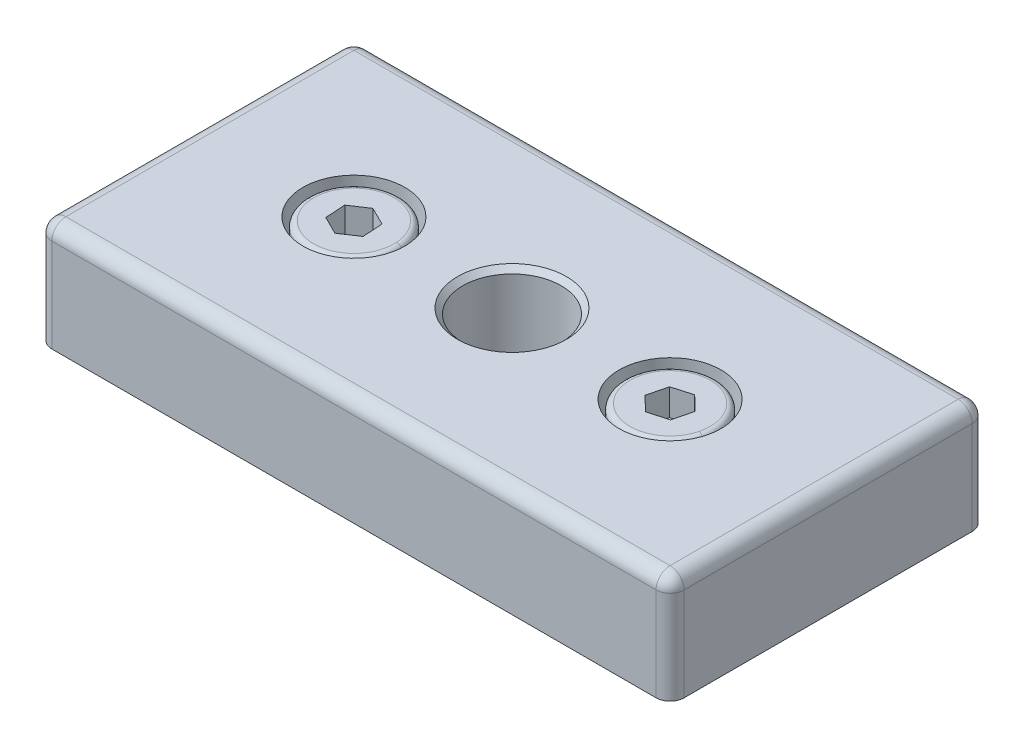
ISO-10303-21;
HEADER;
FILE_DESCRIPTION(('STEP AP214'),'2;1');
FILE_NAME('part.step','',(''),(''),'','','');
FILE_SCHEMA(('AUTOMOTIVE_DESIGN { 1 0 10303 214 1 1 1 1 }'));
ENDSEC;
DATA;
#1=APPLICATION_CONTEXT('core data for automotive mechanical design processes');
#2=APPLICATION_PROTOCOL_DEFINITION('international standard','automotive_design',2000,#1);
#3=PRODUCT_CONTEXT('',#1,'mechanical');
#4=PRODUCT('Part','Part','',(#3));
#5=PRODUCT_RELATED_PRODUCT_CATEGORY('part','',(#4));
#6=PRODUCT_DEFINITION_FORMATION('','',#4);
#7=PRODUCT_DEFINITION_CONTEXT('part definition',#1,'design');
#8=PRODUCT_DEFINITION('design','',#6,#7);
#9=PRODUCT_DEFINITION_SHAPE('','',#8);
#10=(LENGTH_UNIT() NAMED_UNIT(*) SI_UNIT(.MILLI.,.METRE.));
#11=(NAMED_UNIT(*) PLANE_ANGLE_UNIT() SI_UNIT($,.RADIAN.));
#12=(NAMED_UNIT(*) SI_UNIT($,.STERADIAN.) SOLID_ANGLE_UNIT());
#13=UNCERTAINTY_MEASURE_WITH_UNIT(LENGTH_MEASURE(1.E-05),#10,'distance_accuracy_value','');
#14=(GEOMETRIC_REPRESENTATION_CONTEXT(3) GLOBAL_UNCERTAINTY_ASSIGNED_CONTEXT((#13)) GLOBAL_UNIT_ASSIGNED_CONTEXT((#10,
#11,#12)) REPRESENTATION_CONTEXT('',''));
#15=CARTESIAN_POINT('',(0.,0.,0.));
#16=DIRECTION('',(0.,0.,1.));
#17=DIRECTION('',(1.,0.,0.));
#18=AXIS2_PLACEMENT_3D('',#15,#16,#17);
#19=CARTESIAN_POINT('',(-24.2440335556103,7.81977258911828,-2.11639479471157));
#20=DIRECTION('',(0.,1.,0.));
#21=DIRECTION('',(0.998011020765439,0.,-0.0630396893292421));
#22=AXIS2_PLACEMENT_3D('',#19,#20,#21);
#23=CONICAL_SURFACE('',#22,2.5,1.0471975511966);
#24=DIRECTION('',(-0.864302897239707,0.5,0.0545939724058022));
#25=VECTOR('',#24,1.);
#26=CARTESIAN_POINT('',(-26.7390611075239,7.81977258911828,-1.95879557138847));
#27=LINE('',#26,#25);
#28=CARTESIAN_POINT('',(-24.2440335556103,6.37639691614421,-2.11639479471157));
#29=VERTEX_POINT('',#28);
#30=CARTESIAN_POINT('',(-26.7390611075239,7.81977258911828,-1.95879557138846));
#31=VERTEX_POINT('',#30);
#32=EDGE_CURVE('P0_E333',#29,#31,#27,.T.);
#33=ORIENTED_EDGE('',*,*,#32,.F.);
#34=DIRECTION('',(0.864302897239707,0.5,-0.0545939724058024));
#35=VECTOR('',#34,1.);
#36=CARTESIAN_POINT('',(-21.7490060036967,7.81977258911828,-2.27399401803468));
#37=LINE('',#36,#35);
#38=CARTESIAN_POINT('',(-21.7490060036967,7.81977258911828,-2.27399401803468));
#39=VERTEX_POINT('',#38);
#40=EDGE_CURVE('P0_E336',#29,#39,#37,.T.);
#41=ORIENTED_EDGE('',*,*,#40,.T.);
#42=CARTESIAN_POINT('',(-24.2440335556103,7.81977258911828,-2.11639479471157));
#43=DIRECTION('',(0.,1.,0.));
#44=DIRECTION('',(0.998011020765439,0.,-0.0630396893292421));
#45=AXIS2_PLACEMENT_3D('',#42,#43,#44);
#46=CIRCLE('',#45,2.5);
#47=CARTESIAN_POINT('',(-23.133004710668,7.81977258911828,-4.3559516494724));
#48=VERTEX_POINT('',#47);
#49=EDGE_CURVE('P0_E10',#39,#48,#46,.T.);
#50=ORIENTED_EDGE('',*,*,#49,.T.);
#51=CARTESIAN_POINT('',(-24.2440335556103,7.81977258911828,-2.11639479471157));
#52=DIRECTION('',(0.,1.,0.));
#53=DIRECTION('',(0.998011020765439,0.,-0.0630396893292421));
#54=AXIS2_PLACEMENT_3D('',#51,#52,#53);
#55=CIRCLE('',#54,2.5);
#56=CARTESIAN_POINT('',(-25.6280322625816,7.81977258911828,-4.19835242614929));
#57=VERTEX_POINT('',#56);
#58=EDGE_CURVE('P0_E26',#48,#57,#55,.T.);
#59=ORIENTED_EDGE('',*,*,#58,.T.);
#60=CARTESIAN_POINT('',(-24.2440335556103,7.81977258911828,-2.11639479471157));
#61=DIRECTION('',(0.,1.,0.));
#62=DIRECTION('',(0.998011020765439,0.,-0.0630396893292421));
#63=AXIS2_PLACEMENT_3D('',#60,#61,#62);
#64=CIRCLE('',#63,2.5);
#65=EDGE_CURVE('P0_E19',#57,#31,#64,.T.);
#66=ORIENTED_EDGE('',*,*,#65,.T.);
#67=EDGE_LOOP('',(#33,#41,#50,#59,#66));
#68=FACE_BOUND('',#67,.T.);
#69=ADVANCED_FACE('P0_F16',(#68),#23,.F.);
#70=CARTESIAN_POINT('',(-21.8399959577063,7.81977258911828,-3.71449884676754));
#71=DIRECTION('',(0.,1.,0.));
#72=DIRECTION('',(0.998011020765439,0.,-0.0630396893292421));
#73=AXIS2_PLACEMENT_3D('',#70,#71,#72);
#74=PLANE('',#73);
#75=ORIENTED_EDGE('',*,*,#49,.F.);
#76=DIRECTION('',(-0.0630396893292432,0.,-0.998011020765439));
#77=VECTOR('',#76,1.);
#78=CARTESIAN_POINT('',(-21.658016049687,7.81977258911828,-0.833489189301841));
#79=LINE('',#78,#77);
#80=CARTESIAN_POINT('',(-21.8399959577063,7.81977258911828,-3.71449884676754));
#81=VERTEX_POINT('',#80);
#82=EDGE_CURVE('P0_E294',#39,#81,#79,.T.);
#83=ORIENTED_EDGE('',*,*,#82,.T.);
#84=DIRECTION('',(0.895822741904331,0.,0.444411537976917));
#85=VECTOR('',#84,1.);
#86=CARTESIAN_POINT('',(-24.4260134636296,7.81977258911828,-4.99740445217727));
#87=LINE('',#86,#85);
#88=EDGE_CURVE('P0_E275',#48,#81,#87,.T.);
#89=ORIENTED_EDGE('',*,*,#88,.F.);
#90=EDGE_LOOP('',(#75,#83,#89));
#91=FACE_BOUND('',#90,.T.);
#92=ADVANCED_FACE('P0_F598',(#91),#74,.T.);
#93=CARTESIAN_POINT('',(-21.8399959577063,7.81977258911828,-3.71449884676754));
#94=DIRECTION('',(0.,1.,0.));
#95=DIRECTION('',(0.998011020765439,0.,-0.0630396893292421));
#96=AXIS2_PLACEMENT_3D('',#93,#94,#95);
#97=PLANE('',#96);
#98=ORIENTED_EDGE('',*,*,#58,.F.);
#99=DIRECTION('',(0.895822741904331,0.,0.444411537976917));
#100=VECTOR('',#99,1.);
#101=CARTESIAN_POINT('',(-24.4260134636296,7.81977258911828,-4.99740445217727));
#102=LINE('',#101,#100);
#103=CARTESIAN_POINT('',(-24.4260134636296,7.81977258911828,-4.99740445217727));
#104=VERTEX_POINT('',#103);
#105=EDGE_CURVE('P0_E271',#104,#48,#102,.T.);
#106=ORIENTED_EDGE('',*,*,#105,.F.);
#107=DIRECTION('',(-0.832783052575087,0.,0.553599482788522));
#108=VECTOR('',#107,1.);
#109=CARTESIAN_POINT('',(-24.4260134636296,7.81977258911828,-4.99740445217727));
#110=LINE('',#109,#108);
#111=EDGE_CURVE('P0_E207',#104,#57,#110,.T.);
#112=ORIENTED_EDGE('',*,*,#111,.T.);
#113=EDGE_LOOP('',(#98,#106,#112));
#114=FACE_BOUND('',#113,.T.);
#115=ADVANCED_FACE('P0_F599',(#114),#97,.T.);
#116=CARTESIAN_POINT('',(-21.8399959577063,7.81977258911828,-3.71449884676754));
#117=DIRECTION('',(0.,1.,0.));
#118=DIRECTION('',(0.998011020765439,0.,-0.0630396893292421));
#119=AXIS2_PLACEMENT_3D('',#116,#117,#118);
#120=PLANE('',#119);
#121=ORIENTED_EDGE('',*,*,#65,.F.);
#122=DIRECTION('',(-0.832783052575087,0.,0.553599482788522));
#123=VECTOR('',#122,1.);
#124=CARTESIAN_POINT('',(-24.4260134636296,7.81977258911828,-4.99740445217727));
#125=LINE('',#124,#123);
#126=CARTESIAN_POINT('',(-26.8300510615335,7.81977258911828,-3.39930040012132));
#127=VERTEX_POINT('',#126);
#128=EDGE_CURVE('P0_E205',#57,#127,#125,.T.);
#129=ORIENTED_EDGE('',*,*,#128,.T.);
#130=DIRECTION('',(0.0630396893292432,0.,0.998011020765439));
#131=VECTOR('',#130,1.);
#132=CARTESIAN_POINT('',(-26.8300510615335,7.81977258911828,-3.39930040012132));
#133=LINE('',#132,#131);
#134=EDGE_CURVE('P0_E175',#127,#31,#133,.T.);
#135=ORIENTED_EDGE('',*,*,#134,.T.);
#136=EDGE_LOOP('',(#121,#129,#135));
#137=FACE_BOUND('',#136,.T.);
#138=ADVANCED_FACE('P0_F609',(#137),#120,.T.);
#139=CARTESIAN_POINT('',(-21.8399959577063,7.81977258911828,-3.71449884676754));
#140=DIRECTION('',(0.,1.,0.));
#141=DIRECTION('',(0.998011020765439,0.,-0.0630396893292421));
#142=AXIS2_PLACEMENT_3D('',#139,#140,#141);
#143=PLANE('',#142);
#144=CARTESIAN_POINT('',(-24.2440335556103,7.81977258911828,-2.11639479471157));
#145=DIRECTION('',(0.,1.,0.));
#146=DIRECTION('',(0.998011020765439,0.,-0.0630396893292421));
#147=AXIS2_PLACEMENT_3D('',#144,#145,#146);
#148=CIRCLE('',#147,2.5);
#149=CARTESIAN_POINT('',(-25.3550624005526,7.81977258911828,0.123162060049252));
#150=VERTEX_POINT('',#149);
#151=EDGE_CURVE('P0_E170',#31,#150,#148,.T.);
#152=ORIENTED_EDGE('',*,*,#151,.F.);
#153=DIRECTION('',(0.0630396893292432,0.,0.998011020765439));
#154=VECTOR('',#153,1.);
#155=CARTESIAN_POINT('',(-26.8300510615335,7.81977258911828,-3.39930040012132));
#156=LINE('',#155,#154);
#157=CARTESIAN_POINT('',(-26.6480711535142,7.81977258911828,-0.518290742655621));
#158=VERTEX_POINT('',#157);
#159=EDGE_CURVE('P0_E163',#31,#158,#156,.T.);
#160=ORIENTED_EDGE('',*,*,#159,.T.);
#161=DIRECTION('',(-0.895822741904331,0.,-0.444411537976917));
#162=VECTOR('',#161,1.);
#163=CARTESIAN_POINT('',(-24.0620536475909,7.81977258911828,0.764614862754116));
#164=LINE('',#163,#162);
#165=EDGE_CURVE('P0_E167',#150,#158,#164,.T.);
#166=ORIENTED_EDGE('',*,*,#165,.F.);
#167=EDGE_LOOP('',(#152,#160,#166));
#168=FACE_BOUND('',#167,.T.);
#169=ADVANCED_FACE('P0_F165',(#168),#143,.T.);
#170=CARTESIAN_POINT('',(-21.8399959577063,7.81977258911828,-3.71449884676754));
#171=DIRECTION('',(0.,1.,0.));
#172=DIRECTION('',(0.998011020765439,0.,-0.0630396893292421));
#173=AXIS2_PLACEMENT_3D('',#170,#171,#172);
#174=PLANE('',#173);
#175=CARTESIAN_POINT('',(-24.2440335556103,7.81977258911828,-2.11639479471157));
#176=DIRECTION('',(0.,1.,0.));
#177=DIRECTION('',(0.998011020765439,0.,-0.0630396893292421));
#178=AXIS2_PLACEMENT_3D('',#175,#176,#177);
#179=CIRCLE('',#178,2.5);
#180=CARTESIAN_POINT('',(-22.860034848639,7.81977258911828,-0.0344371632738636));
#181=VERTEX_POINT('',#180);
#182=EDGE_CURVE('P0_E317',#150,#181,#179,.T.);
#183=ORIENTED_EDGE('',*,*,#182,.F.);
#184=DIRECTION('',(-0.895822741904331,0.,-0.444411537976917));
#185=VECTOR('',#184,1.);
#186=CARTESIAN_POINT('',(-24.0620536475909,7.81977258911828,0.764614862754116));
#187=LINE('',#186,#185);
#188=CARTESIAN_POINT('',(-24.0620536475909,7.81977258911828,0.764614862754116));
#189=VERTEX_POINT('',#188);
#190=EDGE_CURVE('P0_E189',#189,#150,#187,.T.);
#191=ORIENTED_EDGE('',*,*,#190,.F.);
#192=DIRECTION('',(-0.832783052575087,0.,0.553599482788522));
#193=VECTOR('',#192,1.);
#194=CARTESIAN_POINT('',(-21.658016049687,7.81977258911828,-0.833489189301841));
#195=LINE('',#194,#193);
#196=EDGE_CURVE('P0_E291',#181,#189,#195,.T.);
#197=ORIENTED_EDGE('',*,*,#196,.F.);
#198=EDGE_LOOP('',(#183,#191,#197));
#199=FACE_BOUND('',#198,.T.);
#200=ADVANCED_FACE('P0_F315',(#199),#174,.T.);
#201=CARTESIAN_POINT('',(-21.8399959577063,7.81977258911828,-3.71449884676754));
#202=DIRECTION('',(0.,1.,0.));
#203=DIRECTION('',(0.998011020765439,0.,-0.0630396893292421));
#204=AXIS2_PLACEMENT_3D('',#201,#202,#203);
#205=PLANE('',#204);
#206=CARTESIAN_POINT('',(-24.2440335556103,7.81977258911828,-2.11639479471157));
#207=DIRECTION('',(0.,1.,0.));
#208=DIRECTION('',(0.998011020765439,0.,-0.0630396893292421));
#209=AXIS2_PLACEMENT_3D('',#206,#207,#208);
#210=CIRCLE('',#209,2.5);
#211=EDGE_CURVE('P0_E344',#181,#39,#210,.T.);
#212=ORIENTED_EDGE('',*,*,#211,.F.);
#213=DIRECTION('',(-0.832783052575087,0.,0.553599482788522));
#214=VECTOR('',#213,1.);
#215=CARTESIAN_POINT('',(-21.658016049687,7.81977258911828,-0.833489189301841));
#216=LINE('',#215,#214);
#217=CARTESIAN_POINT('',(-21.658016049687,7.81977258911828,-0.833489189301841));
#218=VERTEX_POINT('',#217);
#219=EDGE_CURVE('P0_E302',#218,#181,#216,.T.);
#220=ORIENTED_EDGE('',*,*,#219,.F.);
#221=DIRECTION('',(-0.0630396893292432,0.,-0.998011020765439));
#222=VECTOR('',#221,1.);
#223=CARTESIAN_POINT('',(-21.658016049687,7.81977258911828,-0.833489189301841));
#224=LINE('',#223,#222);
#225=EDGE_CURVE('P0_E297',#218,#39,#224,.T.);
#226=ORIENTED_EDGE('',*,*,#225,.T.);
#227=EDGE_LOOP('',(#212,#220,#226));
#228=FACE_BOUND('',#227,.T.);
#229=ADVANCED_FACE('P0_F590',(#228),#205,.T.);
#230=CARTESIAN_POINT('',(-24.4260134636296,7.81977258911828,-4.99740445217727));
#231=DIRECTION('',(-0.553599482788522,0.,-0.832783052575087));
#232=DIRECTION('',(0.,1.,0.));
#233=AXIS2_PLACEMENT_3D('',#230,#231,#232);
#234=PLANE('',#233);
#235=DIRECTION('',(-0.832783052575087,0.,0.553599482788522));
#236=VECTOR('',#235,1.);
#237=CARTESIAN_POINT('',(-24.4260134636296,11.6197725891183,-4.99740445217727));
#238=LINE('',#237,#236);
#239=CARTESIAN_POINT('',(-24.4260134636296,11.6197725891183,-4.99740445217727));
#240=VERTEX_POINT('',#239);
#241=CARTESIAN_POINT('',(-26.8300510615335,11.6197725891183,-3.39930040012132));
#242=VERTEX_POINT('',#241);
#243=EDGE_CURVE('P0_E260',#240,#242,#238,.T.);
#244=ORIENTED_EDGE('',*,*,#243,.T.);
#245=DIRECTION('',(0.,1.,0.));
#246=VECTOR('',#245,1.);
#247=CARTESIAN_POINT('',(-26.8300510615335,7.81977258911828,-3.39930040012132));
#248=LINE('',#247,#246);
#249=EDGE_CURVE('P0_E203',#127,#242,#248,.T.);
#250=ORIENTED_EDGE('',*,*,#249,.F.);
#251=ORIENTED_EDGE('',*,*,#128,.F.);
#252=ORIENTED_EDGE('',*,*,#111,.F.);
#253=DIRECTION('',(0.,1.,0.));
#254=VECTOR('',#253,1.);
#255=CARTESIAN_POINT('',(-24.4260134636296,7.81977258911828,-4.99740445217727));
#256=LINE('',#255,#254);
#257=EDGE_CURVE('P0_E276',#104,#240,#256,.T.);
#258=ORIENTED_EDGE('',*,*,#257,.T.);
#259=EDGE_LOOP('',(#244,#250,#251,#252,#258));
#260=FACE_BOUND('',#259,.T.);
#261=ADVANCED_FACE('P0_F606',(#260),#234,.F.);
#262=CARTESIAN_POINT('',(-26.8300510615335,7.81977258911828,-3.39930040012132));
#263=DIRECTION('',(-0.998011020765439,0.,0.0630396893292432));
#264=DIRECTION('',(0.0630396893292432,0.,0.998011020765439));
#265=AXIS2_PLACEMENT_3D('',#262,#263,#264);
#266=PLANE('',#265);
#267=DIRECTION('',(0.0630396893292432,0.,0.998011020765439));
#268=VECTOR('',#267,1.);
#269=CARTESIAN_POINT('',(-26.8300510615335,11.6197725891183,-3.39930040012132));
#270=LINE('',#269,#268);
#271=CARTESIAN_POINT('',(-26.6480711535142,11.6197725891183,-0.518290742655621));
#272=VERTEX_POINT('',#271);
#273=EDGE_CURVE('P0_E181',#242,#272,#270,.T.);
#274=ORIENTED_EDGE('',*,*,#273,.T.);
#275=DIRECTION('',(0.,1.,0.));
#276=VECTOR('',#275,1.);
#277=CARTESIAN_POINT('',(-26.6480711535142,7.81977258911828,-0.518290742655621));
#278=LINE('',#277,#276);
#279=EDGE_CURVE('P0_E176',#158,#272,#278,.T.);
#280=ORIENTED_EDGE('',*,*,#279,.F.);
#281=ORIENTED_EDGE('',*,*,#159,.F.);
#282=ORIENTED_EDGE('',*,*,#134,.F.);
#283=ORIENTED_EDGE('',*,*,#249,.T.);
#284=EDGE_LOOP('',(#274,#280,#281,#282,#283));
#285=FACE_BOUND('',#284,.T.);
#286=ADVANCED_FACE('P0_F179',(#285),#266,.F.);
#287=CARTESIAN_POINT('',(-24.0620536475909,7.81977258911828,0.764614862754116));
#288=DIRECTION('',(0.444411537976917,0.,-0.895822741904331));
#289=DIRECTION('',(0.,-1.,0.));
#290=AXIS2_PLACEMENT_3D('',#287,#288,#289);
#291=PLANE('',#290);
#292=DIRECTION('',(-0.895822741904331,0.,-0.444411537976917));
#293=VECTOR('',#292,1.);
#294=CARTESIAN_POINT('',(-24.0620536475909,11.6197725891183,0.764614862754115));
#295=LINE('',#294,#293);
#296=CARTESIAN_POINT('',(-24.0620536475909,11.6197725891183,0.764614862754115));
#297=VERTEX_POINT('',#296);
#298=EDGE_CURVE('P0_E254',#297,#272,#295,.T.);
#299=ORIENTED_EDGE('',*,*,#298,.F.);
#300=DIRECTION('',(0.,1.,0.));
#301=VECTOR('',#300,1.);
#302=CARTESIAN_POINT('',(-24.0620536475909,7.81977258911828,0.764614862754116));
#303=LINE('',#302,#301);
#304=EDGE_CURVE('P0_E197',#189,#297,#303,.T.);
#305=ORIENTED_EDGE('',*,*,#304,.F.);
#306=ORIENTED_EDGE('',*,*,#190,.T.);
#307=ORIENTED_EDGE('',*,*,#165,.T.);
#308=ORIENTED_EDGE('',*,*,#279,.T.);
#309=EDGE_LOOP('',(#299,#305,#306,#307,#308));
#310=FACE_BOUND('',#309,.T.);
#311=ADVANCED_FACE('P0_F187',(#310),#291,.T.);
#312=CARTESIAN_POINT('',(-21.658016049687,7.81977258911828,-0.833489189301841));
#313=DIRECTION('',(-0.553599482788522,0.,-0.832783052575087));
#314=DIRECTION('',(0.,1.,0.));
#315=AXIS2_PLACEMENT_3D('',#312,#313,#314);
#316=PLANE('',#315);
#317=DIRECTION('',(-0.832783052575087,0.,0.553599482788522));
#318=VECTOR('',#317,1.);
#319=CARTESIAN_POINT('',(-21.658016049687,11.6197725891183,-0.833489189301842));
#320=LINE('',#319,#318);
#321=CARTESIAN_POINT('',(-21.658016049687,11.6197725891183,-0.833489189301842));
#322=VERTEX_POINT('',#321);
#323=EDGE_CURVE('P0_E257',#322,#297,#320,.T.);
#324=ORIENTED_EDGE('',*,*,#323,.F.);
#325=DIRECTION('',(0.,1.,0.));
#326=VECTOR('',#325,1.);
#327=CARTESIAN_POINT('',(-21.658016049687,7.81977258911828,-0.833489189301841));
#328=LINE('',#327,#326);
#329=EDGE_CURVE('P0_E301',#218,#322,#328,.T.);
#330=ORIENTED_EDGE('',*,*,#329,.F.);
#331=ORIENTED_EDGE('',*,*,#219,.T.);
#332=ORIENTED_EDGE('',*,*,#196,.T.);
#333=ORIENTED_EDGE('',*,*,#304,.T.);
#334=EDGE_LOOP('',(#324,#330,#331,#332,#333));
#335=FACE_BOUND('',#334,.T.);
#336=ADVANCED_FACE('P0_F311',(#335),#316,.T.);
#337=CARTESIAN_POINT('',(-21.658016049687,7.81977258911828,-0.833489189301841));
#338=DIRECTION('',(0.998011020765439,0.,-0.0630396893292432));
#339=DIRECTION('',(0.0630396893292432,0.,0.998011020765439));
#340=AXIS2_PLACEMENT_3D('',#337,#338,#339);
#341=PLANE('',#340);
#342=DIRECTION('',(-0.0630396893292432,0.,-0.998011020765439));
#343=VECTOR('',#342,1.);
#344=CARTESIAN_POINT('',(-21.658016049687,11.6197725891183,-0.833489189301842));
#345=LINE('',#344,#343);
#346=CARTESIAN_POINT('',(-21.8399959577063,11.6197725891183,-3.71449884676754));
#347=VERTEX_POINT('',#346);
#348=EDGE_CURVE('P0_E251',#322,#347,#345,.T.);
#349=ORIENTED_EDGE('',*,*,#348,.T.);
#350=DIRECTION('',(0.,1.,0.));
#351=VECTOR('',#350,1.);
#352=CARTESIAN_POINT('',(-21.8399959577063,7.81977258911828,-3.71449884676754));
#353=LINE('',#352,#351);
#354=EDGE_CURVE('P0_E288',#81,#347,#353,.T.);
#355=ORIENTED_EDGE('',*,*,#354,.F.);
#356=ORIENTED_EDGE('',*,*,#82,.F.);
#357=ORIENTED_EDGE('',*,*,#225,.F.);
#358=ORIENTED_EDGE('',*,*,#329,.T.);
#359=EDGE_LOOP('',(#349,#355,#356,#357,#358));
#360=FACE_BOUND('',#359,.T.);
#361=ADVANCED_FACE('P0_F595',(#360),#341,.F.);
#362=CARTESIAN_POINT('',(-24.4260134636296,7.81977258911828,-4.99740445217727));
#363=DIRECTION('',(-0.444411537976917,0.,0.895822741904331));
#364=DIRECTION('',(-0.895822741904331,0.,-0.444411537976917));
#365=AXIS2_PLACEMENT_3D('',#362,#363,#364);
#366=PLANE('',#365);
#367=DIRECTION('',(0.895822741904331,0.,0.444411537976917));
#368=VECTOR('',#367,1.);
#369=CARTESIAN_POINT('',(-24.4260134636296,11.6197725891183,-4.99740445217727));
#370=LINE('',#369,#368);
#371=EDGE_CURVE('P0_E247',#240,#347,#370,.T.);
#372=ORIENTED_EDGE('',*,*,#371,.F.);
#373=ORIENTED_EDGE('',*,*,#257,.F.);
#374=ORIENTED_EDGE('',*,*,#105,.T.);
#375=ORIENTED_EDGE('',*,*,#88,.T.);
#376=ORIENTED_EDGE('',*,*,#354,.T.);
#377=EDGE_LOOP('',(#372,#373,#374,#375,#376));
#378=FACE_BOUND('',#377,.T.);
#379=ADVANCED_FACE('P0_F603',(#378),#366,.T.);
#380=CARTESIAN_POINT('',(-24.2440335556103,10.8197725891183,-2.11639479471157));
#381=DIRECTION('',(0.,1.,0.));
#382=DIRECTION('',(0.998011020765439,0.,-0.0630396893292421));
#383=AXIS2_PLACEMENT_3D('',#380,#381,#382);
#384=TOROIDAL_SURFACE('',#383,5.7,0.8);
#385=CARTESIAN_POINT('',(-29.9326963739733,10.8197725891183,-1.75706856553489));
#386=DIRECTION('',(-0.063039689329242,0.,-0.998011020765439));
#387=DIRECTION('',(0.998011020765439,0.,-0.063039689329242));
#388=AXIS2_PLACEMENT_3D('',#385,#386,#387);
#389=CIRCLE('',#388,0.8);
#390=CARTESIAN_POINT('',(-30.7311051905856,10.8197725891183,-1.7066368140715));
#391=VERTEX_POINT('',#390);
#392=CARTESIAN_POINT('',(-29.9326963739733,11.6197725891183,-1.75706856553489));
#393=VERTEX_POINT('',#392);
#394=EDGE_CURVE('P0_E343',#391,#393,#389,.T.);
#395=ORIENTED_EDGE('',*,*,#394,.F.);
#396=CARTESIAN_POINT('',(-24.2440335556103,10.8197725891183,-2.11639479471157));
#397=DIRECTION('',(0.,-1.,0.));
#398=DIRECTION('',(0.998011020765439,0.,-0.0630396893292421));
#399=AXIS2_PLACEMENT_3D('',#396,#397,#398);
#400=CIRCLE('',#399,6.5);
#401=CARTESIAN_POINT('',(-17.7569619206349,10.8197725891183,-2.52615277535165));
#402=VERTEX_POINT('',#401);
#403=EDGE_CURVE('P0_E267',#402,#391,#400,.T.);
#404=ORIENTED_EDGE('',*,*,#403,.F.);
#405=CARTESIAN_POINT('',(-18.5553707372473,10.8197725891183,-2.47572102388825));
#406=DIRECTION('',(0.0630396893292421,0.,0.998011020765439));
#407=DIRECTION('',(-0.998011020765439,0.,0.0630396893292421));
#408=AXIS2_PLACEMENT_3D('',#405,#406,#407);
#409=CIRCLE('',#408,0.8);
#410=CARTESIAN_POINT('',(-18.5553707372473,11.6197725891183,-2.47572102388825));
#411=VERTEX_POINT('',#410);
#412=EDGE_CURVE('P0_E362',#402,#411,#409,.T.);
#413=ORIENTED_EDGE('',*,*,#412,.T.);
#414=CARTESIAN_POINT('',(-24.2440335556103,11.6197725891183,-2.11639479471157));
#415=DIRECTION('',(0.,1.,0.));
#416=DIRECTION('',(0.998011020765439,0.,-0.0630396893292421));
#417=AXIS2_PLACEMENT_3D('',#414,#415,#416);
#418=CIRCLE('',#417,5.7);
#419=EDGE_CURVE('P0_E244',#393,#411,#418,.T.);
#420=ORIENTED_EDGE('',*,*,#419,.F.);
#421=EDGE_LOOP('',(#395,#404,#413,#420));
#422=FACE_BOUND('',#421,.T.);
#423=ADVANCED_FACE('P0_F640',(#422),#384,.T.);
#424=CARTESIAN_POINT('',(-24.2440335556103,6.21977258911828,-2.11639479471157));
#425=DIRECTION('',(0.,-1.,0.));
#426=DIRECTION('',(-0.998011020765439,0.,0.0630396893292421));
#427=AXIS2_PLACEMENT_3D('',#424,#425,#426);
#428=TOROIDAL_SURFACE('',#427,4.39999999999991,0.4);
#429=CARTESIAN_POINT('',(-19.8527850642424,6.21977258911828,-2.39376942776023));
#430=DIRECTION('',(-0.0630396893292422,0.,-0.998011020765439));
#431=DIRECTION('',(0.998011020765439,0.,-0.0630396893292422));
#432=AXIS2_PLACEMENT_3D('',#429,#430,#431);
#433=CIRCLE('',#432,0.4);
#434=CARTESIAN_POINT('',(-20.2519894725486,6.21977258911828,-2.36855355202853));
#435=VERTEX_POINT('',#434);
#436=CARTESIAN_POINT('',(-19.8527850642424,6.61977258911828,-2.39376942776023));
#437=VERTEX_POINT('',#436);
#438=EDGE_CURVE('P0_E372',#435,#437,#433,.T.);
#439=ORIENTED_EDGE('',*,*,#438,.F.);
#440=CARTESIAN_POINT('',(-24.2440335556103,6.21977258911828,-2.11639479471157));
#441=DIRECTION('',(0.,-1.,0.));
#442=DIRECTION('',(-0.998011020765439,0.,0.0630396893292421));
#443=AXIS2_PLACEMENT_3D('',#440,#441,#442);
#444=CIRCLE('',#443,3.99999999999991);
#445=CARTESIAN_POINT('',(-28.2360776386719,6.21977258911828,-1.86423603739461));
#446=VERTEX_POINT('',#445);
#447=EDGE_CURVE('P0_E227',#446,#435,#444,.T.);
#448=ORIENTED_EDGE('',*,*,#447,.F.);
#449=CARTESIAN_POINT('',(-28.6352820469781,6.21977258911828,-1.83902016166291));
#450=DIRECTION('',(0.0630396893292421,0.,0.998011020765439));
#451=DIRECTION('',(-0.998011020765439,0.,0.0630396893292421));
#452=AXIS2_PLACEMENT_3D('',#449,#450,#451);
#453=CIRCLE('',#452,0.4);
#454=CARTESIAN_POINT('',(-28.6352820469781,6.61977258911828,-1.83902016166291));
#455=VERTEX_POINT('',#454);
#456=EDGE_CURVE('P0_E354',#446,#455,#453,.T.);
#457=ORIENTED_EDGE('',*,*,#456,.T.);
#458=CARTESIAN_POINT('',(-24.2440335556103,6.61977258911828,-2.11639479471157));
#459=DIRECTION('',(0.,1.,0.));
#460=DIRECTION('',(-0.998011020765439,0.,0.0630396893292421));
#461=AXIS2_PLACEMENT_3D('',#458,#459,#460);
#462=CIRCLE('',#461,4.39999999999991);
#463=EDGE_CURVE('P0_E270',#437,#455,#462,.T.);
#464=ORIENTED_EDGE('',*,*,#463,.F.);
#465=EDGE_LOOP('',(#439,#448,#457,#464));
#466=FACE_BOUND('',#465,.T.);
#467=ADVANCED_FACE('P0_F643',(#466),#428,.F.);
#468=CARTESIAN_POINT('',(-24.4526634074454,-18.3802274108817,-5.41931226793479));
#469=DIRECTION('',(0.,-1.,0.));
#470=DIRECTION('',(-0.0630396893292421,0.,-0.998011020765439));
#471=AXIS2_PLACEMENT_3D('',#468,#469,#470);
#472=PLANE('',#471);
#473=CARTESIAN_POINT('',(-24.2440335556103,-18.3802274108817,-2.11639479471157));
#474=DIRECTION('',(0.,1.,0.));
#475=DIRECTION('',(0.998011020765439,0.,-0.0630396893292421));
#476=AXIS2_PLACEMENT_3D('',#473,#474,#475);
#477=CIRCLE('',#476,3.3095);
#478=CARTESIAN_POINT('',(-20.941116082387,-18.3802274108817,-2.32502464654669));
#479=VERTEX_POINT('',#478);
#480=CARTESIAN_POINT('',(-27.5469510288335,-18.3802274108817,-1.90776494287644));
#481=VERTEX_POINT('',#480);
#482=EDGE_CURVE('P0_E350',#479,#481,#477,.T.);
#483=ORIENTED_EDGE('',*,*,#482,.F.);
#484=CARTESIAN_POINT('',(-24.2440335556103,-18.3802274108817,-2.11639479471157));
#485=DIRECTION('',(0.,1.,0.));
#486=DIRECTION('',(0.998011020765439,0.,-0.0630396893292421));
#487=AXIS2_PLACEMENT_3D('',#484,#485,#486);
#488=CIRCLE('',#487,3.3095);
#489=EDGE_CURVE('P0_E280',#481,#479,#488,.T.);
#490=ORIENTED_EDGE('',*,*,#489,.F.);
#491=EDGE_LOOP('',(#483,#490));
#492=FACE_BOUND('',#491,.T.);
#493=ADVANCED_FACE('P0_F649',(#492),#472,.T.);
#494=CARTESIAN_POINT('',(-24.2440335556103,-18.3802274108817,-2.11639479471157));
#495=DIRECTION('',(0.,1.,0.));
#496=DIRECTION('',(0.998011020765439,0.,-0.0630396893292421));
#497=AXIS2_PLACEMENT_3D('',#494,#495,#496);
#498=CONICAL_SURFACE('',#497,3.3095,0.785398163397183);
#499=DIRECTION('',(-0.705700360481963,0.707106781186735,0.0445757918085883));
#500=VECTOR('',#499,1.);
#501=CARTESIAN_POINT('',(-27.5469510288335,-18.3802274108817,-1.90776494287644));
#502=LINE('',#501,#500);
#503=CARTESIAN_POINT('',(-28.2360776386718,-17.6897274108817,-1.86423603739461));
#504=VERTEX_POINT('',#503);
#505=EDGE_CURVE('P0_E345',#481,#504,#502,.T.);
#506=ORIENTED_EDGE('',*,*,#505,.F.);
#507=ORIENTED_EDGE('',*,*,#489,.T.);
#508=DIRECTION('',(0.705700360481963,0.707106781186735,-0.0445757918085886));
#509=VECTOR('',#508,1.);
#510=CARTESIAN_POINT('',(-20.941116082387,-18.3802274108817,-2.32502464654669));
#511=LINE('',#510,#509);
#512=CARTESIAN_POINT('',(-20.2519894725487,-17.6897274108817,-2.36855355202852));
#513=VERTEX_POINT('',#512);
#514=EDGE_CURVE('P0_E384',#479,#513,#511,.T.);
#515=ORIENTED_EDGE('',*,*,#514,.T.);
#516=CARTESIAN_POINT('',(-24.2440335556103,-17.6897274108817,-2.11639479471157));
#517=DIRECTION('',(0.,1.,0.));
#518=DIRECTION('',(0.998011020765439,0.,-0.0630396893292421));
#519=AXIS2_PLACEMENT_3D('',#516,#517,#518);
#520=CIRCLE('',#519,3.99999999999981);
#521=EDGE_CURVE('P0_E277',#504,#513,#520,.T.);
#522=ORIENTED_EDGE('',*,*,#521,.F.);
#523=EDGE_LOOP('',(#506,#507,#515,#522));
#524=FACE_BOUND('',#523,.T.);
#525=ADVANCED_FACE('P0_F653',(#524),#498,.T.);
#526=CARTESIAN_POINT('',(-24.2440335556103,43.3697725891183,-2.11639479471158));
#527=DIRECTION('',(0.,1.,0.));
#528=DIRECTION('',(0.998011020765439,0.,-0.0630396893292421));
#529=AXIS2_PLACEMENT_3D('',#526,#527,#528);
#530=CYLINDRICAL_SURFACE('',#529,3.99999999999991);
#531=DIRECTION('',(0.,1.,0.));
#532=VECTOR('',#531,1.);
#533=CARTESIAN_POINT('',(-28.2360776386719,43.3697725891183,-1.86423603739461));
#534=LINE('',#533,#532);
#535=EDGE_CURVE('P0_E225',#504,#446,#534,.T.);
#536=ORIENTED_EDGE('',*,*,#535,.F.);
#537=ORIENTED_EDGE('',*,*,#521,.T.);
#538=DIRECTION('',(0.,1.,0.));
#539=VECTOR('',#538,1.);
#540=CARTESIAN_POINT('',(-20.2519894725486,43.3697725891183,-2.36855355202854));
#541=LINE('',#540,#539);
#542=EDGE_CURVE('P0_E231',#513,#435,#541,.T.);
#543=ORIENTED_EDGE('',*,*,#542,.T.);
#544=CARTESIAN_POINT('',(-24.2440335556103,6.21977258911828,-2.11639479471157));
#545=DIRECTION('',(0.,-1.,0.));
#546=DIRECTION('',(-0.998011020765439,0.,0.0630396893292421));
#547=AXIS2_PLACEMENT_3D('',#544,#545,#546);
#548=CIRCLE('',#547,3.99999999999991);
#549=EDGE_CURVE('P0_E366',#435,#446,#548,.T.);
#550=ORIENTED_EDGE('',*,*,#549,.T.);
#551=EDGE_LOOP('',(#536,#537,#543,#550));
#552=FACE_BOUND('',#551,.T.);
#553=ADVANCED_FACE('P0_F414',(#552),#530,.T.);
#554=CARTESIAN_POINT('',(-24.6537915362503,6.61977258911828,-8.60346642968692));
#555=DIRECTION('',(0.,-1.,0.));
#556=DIRECTION('',(-0.0630396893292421,0.,-0.998011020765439));
#557=AXIS2_PLACEMENT_3D('',#554,#555,#556);
#558=PLANE('',#557);
#559=CARTESIAN_POINT('',(-24.2440335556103,6.61977258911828,-2.11639479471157));
#560=DIRECTION('',(0.,1.,0.));
#561=DIRECTION('',(-0.998011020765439,0.,0.0630396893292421));
#562=AXIS2_PLACEMENT_3D('',#559,#560,#561);
#563=CIRCLE('',#562,4.39999999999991);
#564=EDGE_CURVE('P0_E376',#455,#437,#563,.T.);
#565=ORIENTED_EDGE('',*,*,#564,.T.);
#566=ORIENTED_EDGE('',*,*,#463,.T.);
#567=EDGE_LOOP('',(#565,#566));
#568=FACE_BOUND('',#567,.T.);
#569=CARTESIAN_POINT('',(-24.2440335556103,6.61977258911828,-2.11639479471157));
#570=DIRECTION('',(0.,1.,0.));
#571=DIRECTION('',(0.998011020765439,0.,-0.0630396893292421));
#572=AXIS2_PLACEMENT_3D('',#569,#570,#571);
#573=CIRCLE('',#572,6.5);
#574=CARTESIAN_POINT('',(-17.7569619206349,6.61977258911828,-2.52615277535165));
#575=VERTEX_POINT('',#574);
#576=CARTESIAN_POINT('',(-30.7311051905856,6.61977258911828,-1.7066368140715));
#577=VERTEX_POINT('',#576);
#578=EDGE_CURVE('P0_E235',#575,#577,#573,.T.);
#579=ORIENTED_EDGE('',*,*,#578,.F.);
#580=CARTESIAN_POINT('',(-24.2440335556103,6.61977258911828,-2.11639479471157));
#581=DIRECTION('',(0.,1.,0.));
#582=DIRECTION('',(0.998011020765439,0.,-0.0630396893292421));
#583=AXIS2_PLACEMENT_3D('',#580,#581,#582);
#584=CIRCLE('',#583,6.5);
#585=EDGE_CURVE('P0_E264',#577,#575,#584,.T.);
#586=ORIENTED_EDGE('',*,*,#585,.F.);
#587=EDGE_LOOP('',(#579,#586));
#588=FACE_BOUND('',#587,.T.);
#589=ADVANCED_FACE('P0_F659',(#568,#588),#558,.T.);
#590=CARTESIAN_POINT('',(-24.2440335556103,43.3697725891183,-2.11639479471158));
#591=DIRECTION('',(0.,1.,0.));
#592=DIRECTION('',(0.998011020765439,0.,-0.0630396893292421));
#593=AXIS2_PLACEMENT_3D('',#590,#591,#592);
#594=CYLINDRICAL_SURFACE('',#593,6.5);
#595=DIRECTION('',(0.,1.,0.));
#596=VECTOR('',#595,1.);
#597=CARTESIAN_POINT('',(-30.7311051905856,43.3697725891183,-1.7066368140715));
#598=LINE('',#597,#596);
#599=EDGE_CURVE('P0_E236',#577,#391,#598,.T.);
#600=ORIENTED_EDGE('',*,*,#599,.F.);
#601=ORIENTED_EDGE('',*,*,#585,.T.);
#602=DIRECTION('',(0.,1.,0.));
#603=VECTOR('',#602,1.);
#604=CARTESIAN_POINT('',(-17.7569619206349,43.3697725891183,-2.52615277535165));
#605=LINE('',#604,#603);
#606=EDGE_CURVE('P0_E240',#575,#402,#605,.T.);
#607=ORIENTED_EDGE('',*,*,#606,.T.);
#608=ORIENTED_EDGE('',*,*,#403,.T.);
#609=EDGE_LOOP('',(#600,#601,#607,#608));
#610=FACE_BOUND('',#609,.T.);
#611=ADVANCED_FACE('P0_F662',(#610),#594,.T.);
#612=CARTESIAN_POINT('',(-24.2440335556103,11.6197725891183,-2.11639479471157));
#613=DIRECTION('',(0.,1.,0.));
#614=DIRECTION('',(0.998011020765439,0.,-0.0630396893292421));
#615=AXIS2_PLACEMENT_3D('',#612,#613,#614);
#616=PLANE('',#615);
#617=ORIENTED_EDGE('',*,*,#371,.T.);
#618=ORIENTED_EDGE('',*,*,#348,.F.);
#619=ORIENTED_EDGE('',*,*,#323,.T.);
#620=ORIENTED_EDGE('',*,*,#298,.T.);
#621=ORIENTED_EDGE('',*,*,#273,.F.);
#622=ORIENTED_EDGE('',*,*,#243,.F.);
#623=EDGE_LOOP('',(#617,#618,#619,#620,#621,#622));
#624=FACE_BOUND('',#623,.T.);
#625=CARTESIAN_POINT('',(-24.2440335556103,11.6197725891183,-2.11639479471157));
#626=DIRECTION('',(0.,1.,0.));
#627=DIRECTION('',(0.998011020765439,0.,-0.0630396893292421));
#628=AXIS2_PLACEMENT_3D('',#625,#626,#627);
#629=CIRCLE('',#628,5.7);
#630=EDGE_CURVE('P0_E358',#411,#393,#629,.T.);
#631=ORIENTED_EDGE('',*,*,#630,.T.);
#632=ORIENTED_EDGE('',*,*,#419,.T.);
#633=EDGE_LOOP('',(#631,#632));
#634=FACE_BOUND('',#633,.T.);
#635=ADVANCED_FACE('P0_F321',(#624,#634),#616,.T.);
#636=CARTESIAN_POINT('',(-24.2440335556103,43.3697725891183,-2.11639479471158));
#637=DIRECTION('',(0.,1.,0.));
#638=DIRECTION('',(0.998011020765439,0.,-0.0630396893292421));
#639=AXIS2_PLACEMENT_3D('',#636,#637,#638);
#640=CYLINDRICAL_SURFACE('',#639,6.5);
#641=ORIENTED_EDGE('',*,*,#578,.T.);
#642=ORIENTED_EDGE('',*,*,#599,.T.);
#643=CARTESIAN_POINT('',(-24.2440335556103,10.8197725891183,-2.11639479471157));
#644=DIRECTION('',(0.,-1.,0.));
#645=DIRECTION('',(0.998011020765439,0.,-0.0630396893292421));
#646=AXIS2_PLACEMENT_3D('',#643,#644,#645);
#647=CIRCLE('',#646,6.5);
#648=EDGE_CURVE('P0_E339',#391,#402,#647,.T.);
#649=ORIENTED_EDGE('',*,*,#648,.T.);
#650=ORIENTED_EDGE('',*,*,#606,.F.);
#651=EDGE_LOOP('',(#641,#642,#649,#650));
#652=FACE_BOUND('',#651,.T.);
#653=ADVANCED_FACE('P0_F669',(#652),#640,.T.);
#654=CARTESIAN_POINT('',(-24.2440335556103,43.3697725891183,-2.11639479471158));
#655=DIRECTION('',(0.,1.,0.));
#656=DIRECTION('',(0.998011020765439,0.,-0.0630396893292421));
#657=AXIS2_PLACEMENT_3D('',#654,#655,#656);
#658=CYLINDRICAL_SURFACE('',#657,3.99999999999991);
#659=CARTESIAN_POINT('',(-24.2440335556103,-17.6897274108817,-2.11639479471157));
#660=DIRECTION('',(0.,1.,0.));
#661=DIRECTION('',(0.998011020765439,0.,-0.0630396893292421));
#662=AXIS2_PLACEMENT_3D('',#659,#660,#661);
#663=CIRCLE('',#662,3.99999999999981);
#664=EDGE_CURVE('P0_E349',#513,#504,#663,.T.);
#665=ORIENTED_EDGE('',*,*,#664,.T.);
#666=ORIENTED_EDGE('',*,*,#535,.T.);
#667=ORIENTED_EDGE('',*,*,#447,.T.);
#668=ORIENTED_EDGE('',*,*,#542,.F.);
#669=EDGE_LOOP('',(#665,#666,#667,#668));
#670=FACE_BOUND('',#669,.T.);
#671=ADVANCED_FACE('P0_F673',(#670),#658,.T.);
#672=CARTESIAN_POINT('',(-24.2440335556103,-18.3802274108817,-2.11639479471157));
#673=DIRECTION('',(0.,1.,0.));
#674=DIRECTION('',(0.998011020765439,0.,-0.0630396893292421));
#675=AXIS2_PLACEMENT_3D('',#672,#673,#674);
#676=CONICAL_SURFACE('',#675,3.3095,0.785398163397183);
#677=ORIENTED_EDGE('',*,*,#482,.T.);
#678=ORIENTED_EDGE('',*,*,#505,.T.);
#679=ORIENTED_EDGE('',*,*,#664,.F.);
#680=ORIENTED_EDGE('',*,*,#514,.F.);
#681=EDGE_LOOP('',(#677,#678,#679,#680));
#682=FACE_BOUND('',#681,.T.);
#683=ADVANCED_FACE('P0_F670',(#682),#676,.T.);
#684=CARTESIAN_POINT('',(-24.2440335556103,6.21977258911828,-2.11639479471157));
#685=DIRECTION('',(0.,-1.,0.));
#686=DIRECTION('',(-0.998011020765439,0.,0.0630396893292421));
#687=AXIS2_PLACEMENT_3D('',#684,#685,#686);
#688=TOROIDAL_SURFACE('',#687,4.39999999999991,0.4);
#689=ORIENTED_EDGE('',*,*,#549,.F.);
#690=ORIENTED_EDGE('',*,*,#438,.T.);
#691=ORIENTED_EDGE('',*,*,#564,.F.);
#692=ORIENTED_EDGE('',*,*,#456,.F.);
#693=EDGE_LOOP('',(#689,#690,#691,#692));
#694=FACE_BOUND('',#693,.T.);
#695=ADVANCED_FACE('P0_F417',(#694),#688,.F.);
#696=CARTESIAN_POINT('',(-24.2440335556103,10.8197725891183,-2.11639479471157));
#697=DIRECTION('',(0.,1.,0.));
#698=DIRECTION('',(0.998011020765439,0.,-0.0630396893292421));
#699=AXIS2_PLACEMENT_3D('',#696,#697,#698);
#700=TOROIDAL_SURFACE('',#699,5.7,0.8);
#701=ORIENTED_EDGE('',*,*,#648,.F.);
#702=ORIENTED_EDGE('',*,*,#394,.T.);
#703=ORIENTED_EDGE('',*,*,#630,.F.);
#704=ORIENTED_EDGE('',*,*,#412,.F.);
#705=EDGE_LOOP('',(#701,#702,#703,#704));
#706=FACE_BOUND('',#705,.T.);
#707=ADVANCED_FACE('P0_F680',(#706),#700,.T.);
#708=CARTESIAN_POINT('',(-24.2440335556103,7.81977258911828,-2.11639479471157));
#709=DIRECTION('',(0.,1.,0.));
#710=DIRECTION('',(0.998011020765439,0.,-0.0630396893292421));
#711=AXIS2_PLACEMENT_3D('',#708,#709,#710);
#712=CONICAL_SURFACE('',#711,2.5,1.0471975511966);
#713=ORIENTED_EDGE('',*,*,#40,.F.);
#714=ORIENTED_EDGE('',*,*,#32,.T.);
#715=ORIENTED_EDGE('',*,*,#151,.T.);
#716=ORIENTED_EDGE('',*,*,#182,.T.);
#717=ORIENTED_EDGE('',*,*,#211,.T.);
#718=EDGE_LOOP('',(#713,#714,#715,#716,#717));
#719=FACE_BOUND('',#718,.T.);
#720=ADVANCED_FACE('P0_F588',(#719),#712,.F.);
#721=CLOSED_SHELL('',(#69,#92,#115,#138,#169,#200,#229,#261,#286,#311,#336,#361,#379,#423,#467,
#493,#525,#553,#589,#611,#635,#653,#671,#683,#695,#707,#720));
#722=MANIFOLD_SOLID_BREP('P0_B1',#721);
#723=CARTESIAN_POINT('',(20.7559664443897,7.81977258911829,-2.11639479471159));
#724=DIRECTION('',(0.,1.,0.));
#725=DIRECTION('',(-0.970205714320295,0.,-0.242282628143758));
#726=AXIS2_PLACEMENT_3D('',#723,#724,#725);
#727=CONICAL_SURFACE('',#726,2.5,1.0471975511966);
#728=DIRECTION('',(0.840222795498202,0.5,0.209822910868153));
#729=VECTOR('',#728,1.);
#730=CARTESIAN_POINT('',(23.1814807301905,7.81977258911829,-1.51068822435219));
#731=LINE('',#730,#729);
#732=CARTESIAN_POINT('',(20.7559664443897,6.37639691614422,-2.11639479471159));
#733=VERTEX_POINT('',#732);
#734=CARTESIAN_POINT('',(23.1814807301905,7.81977258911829,-1.5106882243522));
#735=VERTEX_POINT('',#734);
#736=EDGE_CURVE('P1_E334',#733,#735,#731,.T.);
#737=ORIENTED_EDGE('',*,*,#736,.F.);
#738=DIRECTION('',(-0.840222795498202,0.5,-0.209822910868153));
#739=VECTOR('',#738,1.);
#740=CARTESIAN_POINT('',(18.330452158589,7.81977258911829,-2.72210136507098));
#741=LINE('',#740,#739);
#742=CARTESIAN_POINT('',(18.330452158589,7.81977258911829,-2.72210136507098));
#743=VERTEX_POINT('',#742);
#744=EDGE_CURVE('P1_E337',#733,#743,#741,.T.);
#745=ORIENTED_EDGE('',*,*,#744,.T.);
#746=CARTESIAN_POINT('',(20.7559664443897,7.81977258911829,-2.11639479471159));
#747=DIRECTION('',(0.,1.,0.));
#748=DIRECTION('',(-0.970205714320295,0.,-0.242282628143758));
#749=AXIS2_PLACEMENT_3D('',#746,#747,#748);
#750=CIRCLE('',#749,2.5);
#751=CARTESIAN_POINT('',(19.018652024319,7.81977258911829,-0.318691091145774));
#752=VERTEX_POINT('',#751);
#753=EDGE_CURVE('P1_E11',#743,#752,#750,.T.);
#754=ORIENTED_EDGE('',*,*,#753,.T.);
#755=CARTESIAN_POINT('',(20.7559664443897,7.81977258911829,-2.11639479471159));
#756=DIRECTION('',(0.,1.,0.));
#757=DIRECTION('',(-0.970205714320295,0.,-0.242282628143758));
#758=AXIS2_PLACEMENT_3D('',#755,#756,#757);
#759=CIRCLE('',#758,2.5);
#760=CARTESIAN_POINT('',(21.4441663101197,7.81977258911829,0.28701547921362));
#761=VERTEX_POINT('',#760);
#762=EDGE_CURVE('P1_E27',#752,#761,#759,.T.);
#763=ORIENTED_EDGE('',*,*,#762,.T.);
#764=CARTESIAN_POINT('',(20.7559664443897,7.81977258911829,-2.11639479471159));
#765=DIRECTION('',(0.,1.,0.));
#766=DIRECTION('',(-0.970205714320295,0.,-0.242282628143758));
#767=AXIS2_PLACEMENT_3D('',#764,#765,#766);
#768=CIRCLE('',#767,2.5);
#769=EDGE_CURVE('P1_E20',#761,#735,#768,.T.);
#770=ORIENTED_EDGE('',*,*,#769,.T.);
#771=EDGE_LOOP('',(#737,#745,#754,#763,#770));
#772=FACE_BOUND('',#771,.T.);
#773=ADVANCED_FACE('P1_F17',(#772),#727,.F.);
#774=CARTESIAN_POINT('',(17.9807473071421,7.81977258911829,-1.32173003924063));
#775=DIRECTION('',(0.,1.,0.));
#776=DIRECTION('',(-0.970205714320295,0.,-0.242282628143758));
#777=AXIS2_PLACEMENT_3D('',#774,#775,#776);
#778=PLANE('',#777);
#779=ORIENTED_EDGE('',*,*,#753,.F.);
#780=DIRECTION('',(-0.242282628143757,0.,0.970205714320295));
#781=VECTOR('',#780,1.);
#782=CARTESIAN_POINT('',(18.6801570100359,7.81977258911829,-4.12247269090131));
#783=LINE('',#782,#781);
#784=CARTESIAN_POINT('',(17.9807473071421,7.81977258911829,-1.32173003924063));
#785=VERTEX_POINT('',#784);
#786=EDGE_CURVE('P1_E295',#743,#785,#783,.T.);
#787=ORIENTED_EDGE('',*,*,#786,.T.);
#788=DIRECTION('',(-0.719081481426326,0.,-0.694925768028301));
#789=VECTOR('',#788,1.);
#790=CARTESIAN_POINT('',(20.0565567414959,7.81977258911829,0.684347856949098));
#791=LINE('',#790,#789);
#792=EDGE_CURVE('P1_E276',#752,#785,#791,.T.);
#793=ORIENTED_EDGE('',*,*,#792,.F.);
#794=EDGE_LOOP('',(#779,#787,#793));
#795=FACE_BOUND('',#794,.T.);
#796=ADVANCED_FACE('P1_F599',(#795),#778,.T.);
#797=CARTESIAN_POINT('',(17.9807473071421,7.81977258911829,-1.32173003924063));
#798=DIRECTION('',(0.,1.,0.));
#799=DIRECTION('',(-0.970205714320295,0.,-0.242282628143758));
#800=AXIS2_PLACEMENT_3D('',#797,#798,#799);
#801=PLANE('',#800);
#802=ORIENTED_EDGE('',*,*,#762,.F.);
#803=DIRECTION('',(-0.719081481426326,0.,-0.694925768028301));
#804=VECTOR('',#803,1.);
#805=CARTESIAN_POINT('',(20.0565567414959,7.81977258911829,0.684347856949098));
#806=LINE('',#805,#804);
#807=CARTESIAN_POINT('',(20.0565567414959,7.81977258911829,0.684347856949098));
#808=VERTEX_POINT('',#807);
#809=EDGE_CURVE('P1_E272',#808,#752,#806,.T.);
#810=ORIENTED_EDGE('',*,*,#809,.F.);
#811=DIRECTION('',(0.961364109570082,0.,-0.275279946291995));
#812=VECTOR('',#811,1.);
#813=CARTESIAN_POINT('',(20.0565567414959,7.81977258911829,0.684347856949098));
#814=LINE('',#813,#812);
#815=EDGE_CURVE('P1_E208',#808,#761,#814,.T.);
#816=ORIENTED_EDGE('',*,*,#815,.T.);
#817=EDGE_LOOP('',(#802,#810,#816));
#818=FACE_BOUND('',#817,.T.);
#819=ADVANCED_FACE('P1_F600',(#818),#801,.T.);
#820=CARTESIAN_POINT('',(17.9807473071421,7.81977258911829,-1.32173003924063));
#821=DIRECTION('',(0.,1.,0.));
#822=DIRECTION('',(-0.970205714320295,0.,-0.242282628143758));
#823=AXIS2_PLACEMENT_3D('',#820,#821,#822);
#824=PLANE('',#823);
#825=ORIENTED_EDGE('',*,*,#769,.F.);
#826=DIRECTION('',(0.961364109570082,0.,-0.275279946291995));
#827=VECTOR('',#826,1.);
#828=CARTESIAN_POINT('',(20.0565567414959,7.81977258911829,0.684347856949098));
#829=LINE('',#828,#827);
#830=CARTESIAN_POINT('',(22.8317758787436,7.81977258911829,-0.110316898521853));
#831=VERTEX_POINT('',#830);
#832=EDGE_CURVE('P1_E206',#761,#831,#829,.T.);
#833=ORIENTED_EDGE('',*,*,#832,.T.);
#834=DIRECTION('',(0.242282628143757,0.,-0.970205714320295));
#835=VECTOR('',#834,1.);
#836=CARTESIAN_POINT('',(22.8317758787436,7.81977258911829,-0.110316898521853));
#837=LINE('',#836,#835);
#838=EDGE_CURVE('P1_E176',#831,#735,#837,.T.);
#839=ORIENTED_EDGE('',*,*,#838,.T.);
#840=EDGE_LOOP('',(#825,#833,#839));
#841=FACE_BOUND('',#840,.T.);
#842=ADVANCED_FACE('P1_F610',(#841),#824,.T.);
#843=CARTESIAN_POINT('',(17.9807473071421,7.81977258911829,-1.32173003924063));
#844=DIRECTION('',(0.,1.,0.));
#845=DIRECTION('',(-0.970205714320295,0.,-0.242282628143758));
#846=AXIS2_PLACEMENT_3D('',#843,#844,#845);
#847=PLANE('',#846);
#848=CARTESIAN_POINT('',(20.7559664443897,7.81977258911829,-2.11639479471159));
#849=DIRECTION('',(0.,1.,0.));
#850=DIRECTION('',(-0.970205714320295,0.,-0.242282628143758));
#851=AXIS2_PLACEMENT_3D('',#848,#849,#850);
#852=CIRCLE('',#851,2.5);
#853=CARTESIAN_POINT('',(22.4932808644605,7.81977258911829,-3.9140984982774));
#854=VERTEX_POINT('',#853);
#855=EDGE_CURVE('P1_E171',#735,#854,#852,.T.);
#856=ORIENTED_EDGE('',*,*,#855,.F.);
#857=DIRECTION('',(0.242282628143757,0.,-0.970205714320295));
#858=VECTOR('',#857,1.);
#859=CARTESIAN_POINT('',(22.8317758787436,7.81977258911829,-0.110316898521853));
#860=LINE('',#859,#858);
#861=CARTESIAN_POINT('',(23.5311855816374,7.81977258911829,-2.91105955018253));
#862=VERTEX_POINT('',#861);
#863=EDGE_CURVE('P1_E164',#735,#862,#860,.T.);
#864=ORIENTED_EDGE('',*,*,#863,.T.);
#865=DIRECTION('',(0.719081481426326,0.,0.694925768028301));
#866=VECTOR('',#865,1.);
#867=CARTESIAN_POINT('',(21.4553761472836,7.81977258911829,-4.91713744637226));
#868=LINE('',#867,#866);
#869=EDGE_CURVE('P1_E168',#854,#862,#868,.T.);
#870=ORIENTED_EDGE('',*,*,#869,.F.);
#871=EDGE_LOOP('',(#856,#864,#870));
#872=FACE_BOUND('',#871,.T.);
#873=ADVANCED_FACE('P1_F166',(#872),#847,.T.);
#874=CARTESIAN_POINT('',(17.9807473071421,7.81977258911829,-1.32173003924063));
#875=DIRECTION('',(0.,1.,0.));
#876=DIRECTION('',(-0.970205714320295,0.,-0.242282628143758));
#877=AXIS2_PLACEMENT_3D('',#874,#875,#876);
#878=PLANE('',#877);
#879=CARTESIAN_POINT('',(20.7559664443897,7.81977258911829,-2.11639479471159));
#880=DIRECTION('',(0.,1.,0.));
#881=DIRECTION('',(-0.970205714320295,0.,-0.242282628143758));
#882=AXIS2_PLACEMENT_3D('',#879,#880,#881);
#883=CIRCLE('',#882,2.5);
#884=CARTESIAN_POINT('',(20.0677665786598,7.81977258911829,-4.51980506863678));
#885=VERTEX_POINT('',#884);
#886=EDGE_CURVE('P1_E318',#854,#885,#883,.T.);
#887=ORIENTED_EDGE('',*,*,#886,.F.);
#888=DIRECTION('',(0.719081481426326,0.,0.694925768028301));
#889=VECTOR('',#888,1.);
#890=CARTESIAN_POINT('',(21.4553761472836,7.81977258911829,-4.91713744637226));
#891=LINE('',#890,#889);
#892=CARTESIAN_POINT('',(21.4553761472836,7.81977258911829,-4.91713744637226));
#893=VERTEX_POINT('',#892);
#894=EDGE_CURVE('P1_E190',#893,#854,#891,.T.);
#895=ORIENTED_EDGE('',*,*,#894,.F.);
#896=DIRECTION('',(0.961364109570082,0.,-0.275279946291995));
#897=VECTOR('',#896,1.);
#898=CARTESIAN_POINT('',(18.6801570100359,7.81977258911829,-4.12247269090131));
#899=LINE('',#898,#897);
#900=EDGE_CURVE('P1_E292',#885,#893,#899,.T.);
#901=ORIENTED_EDGE('',*,*,#900,.F.);
#902=EDGE_LOOP('',(#887,#895,#901));
#903=FACE_BOUND('',#902,.T.);
#904=ADVANCED_FACE('P1_F316',(#903),#878,.T.);
#905=CARTESIAN_POINT('',(17.9807473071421,7.81977258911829,-1.32173003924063));
#906=DIRECTION('',(0.,1.,0.));
#907=DIRECTION('',(-0.970205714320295,0.,-0.242282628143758));
#908=AXIS2_PLACEMENT_3D('',#905,#906,#907);
#909=PLANE('',#908);
#910=CARTESIAN_POINT('',(20.7559664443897,7.81977258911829,-2.11639479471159));
#911=DIRECTION('',(0.,1.,0.));
#912=DIRECTION('',(-0.970205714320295,0.,-0.242282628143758));
#913=AXIS2_PLACEMENT_3D('',#910,#911,#912);
#914=CIRCLE('',#913,2.5);
#915=EDGE_CURVE('P1_E345',#885,#743,#914,.T.);
#916=ORIENTED_EDGE('',*,*,#915,.F.);
#917=DIRECTION('',(0.961364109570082,0.,-0.275279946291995));
#918=VECTOR('',#917,1.);
#919=CARTESIAN_POINT('',(18.6801570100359,7.81977258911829,-4.12247269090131));
#920=LINE('',#919,#918);
#921=CARTESIAN_POINT('',(18.6801570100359,7.81977258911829,-4.12247269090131));
#922=VERTEX_POINT('',#921);
#923=EDGE_CURVE('P1_E303',#922,#885,#920,.T.);
#924=ORIENTED_EDGE('',*,*,#923,.F.);
#925=DIRECTION('',(-0.242282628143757,0.,0.970205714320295));
#926=VECTOR('',#925,1.);
#927=CARTESIAN_POINT('',(18.6801570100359,7.81977258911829,-4.12247269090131));
#928=LINE('',#927,#926);
#929=EDGE_CURVE('P1_E298',#922,#743,#928,.T.);
#930=ORIENTED_EDGE('',*,*,#929,.T.);
#931=EDGE_LOOP('',(#916,#924,#930));
#932=FACE_BOUND('',#931,.T.);
#933=ADVANCED_FACE('P1_F591',(#932),#909,.T.);
#934=CARTESIAN_POINT('',(20.0565567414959,7.81977258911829,0.684347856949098));
#935=DIRECTION('',(0.275279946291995,0.,0.961364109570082));
#936=DIRECTION('',(0.,1.,0.));
#937=AXIS2_PLACEMENT_3D('',#934,#935,#936);
#938=PLANE('',#937);
#939=DIRECTION('',(0.961364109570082,0.,-0.275279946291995));
#940=VECTOR('',#939,1.);
#941=CARTESIAN_POINT('',(20.0565567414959,11.6197725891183,0.684347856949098));
#942=LINE('',#941,#940);
#943=CARTESIAN_POINT('',(20.0565567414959,11.6197725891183,0.684347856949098));
#944=VERTEX_POINT('',#943);
#945=CARTESIAN_POINT('',(22.8317758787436,11.6197725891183,-0.110316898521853));
#946=VERTEX_POINT('',#945);
#947=EDGE_CURVE('P1_E261',#944,#946,#942,.T.);
#948=ORIENTED_EDGE('',*,*,#947,.T.);
#949=DIRECTION('',(0.,1.,0.));
#950=VECTOR('',#949,1.);
#951=CARTESIAN_POINT('',(22.8317758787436,7.81977258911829,-0.110316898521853));
#952=LINE('',#951,#950);
#953=EDGE_CURVE('P1_E204',#831,#946,#952,.T.);
#954=ORIENTED_EDGE('',*,*,#953,.F.);
#955=ORIENTED_EDGE('',*,*,#832,.F.);
#956=ORIENTED_EDGE('',*,*,#815,.F.);
#957=DIRECTION('',(0.,1.,0.));
#958=VECTOR('',#957,1.);
#959=CARTESIAN_POINT('',(20.0565567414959,7.81977258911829,0.684347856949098));
#960=LINE('',#959,#958);
#961=EDGE_CURVE('P1_E277',#808,#944,#960,.T.);
#962=ORIENTED_EDGE('',*,*,#961,.T.);
#963=EDGE_LOOP('',(#948,#954,#955,#956,#962));
#964=FACE_BOUND('',#963,.T.);
#965=ADVANCED_FACE('P1_F607',(#964),#938,.F.);
#966=CARTESIAN_POINT('',(22.8317758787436,7.81977258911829,-0.110316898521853));
#967=DIRECTION('',(0.970205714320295,0.,0.242282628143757));
#968=DIRECTION('',(0.242282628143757,0.,-0.970205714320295));
#969=AXIS2_PLACEMENT_3D('',#966,#967,#968);
#970=PLANE('',#969);
#971=DIRECTION('',(0.242282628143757,0.,-0.970205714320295));
#972=VECTOR('',#971,1.);
#973=CARTESIAN_POINT('',(22.8317758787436,11.6197725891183,-0.110316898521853));
#974=LINE('',#973,#972);
#975=CARTESIAN_POINT('',(23.5311855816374,11.6197725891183,-2.91105955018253));
#976=VERTEX_POINT('',#975);
#977=EDGE_CURVE('P1_E182',#946,#976,#974,.T.);
#978=ORIENTED_EDGE('',*,*,#977,.T.);
#979=DIRECTION('',(0.,1.,0.));
#980=VECTOR('',#979,1.);
#981=CARTESIAN_POINT('',(23.5311855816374,7.81977258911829,-2.91105955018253));
#982=LINE('',#981,#980);
#983=EDGE_CURVE('P1_E177',#862,#976,#982,.T.);
#984=ORIENTED_EDGE('',*,*,#983,.F.);
#985=ORIENTED_EDGE('',*,*,#863,.F.);
#986=ORIENTED_EDGE('',*,*,#838,.F.);
#987=ORIENTED_EDGE('',*,*,#953,.T.);
#988=EDGE_LOOP('',(#978,#984,#985,#986,#987));
#989=FACE_BOUND('',#988,.T.);
#990=ADVANCED_FACE('P1_F180',(#989),#970,.F.);
#991=CARTESIAN_POINT('',(21.4553761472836,7.81977258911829,-4.91713744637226));
#992=DIRECTION('',(-0.694925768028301,0.,0.719081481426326));
#993=DIRECTION('',(0.,-1.,0.));
#994=AXIS2_PLACEMENT_3D('',#991,#992,#993);
#995=PLANE('',#994);
#996=DIRECTION('',(0.719081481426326,0.,0.694925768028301));
#997=VECTOR('',#996,1.);
#998=CARTESIAN_POINT('',(21.4553761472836,11.6197725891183,-4.91713744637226));
#999=LINE('',#998,#997);
#1000=CARTESIAN_POINT('',(21.4553761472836,11.6197725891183,-4.91713744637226));
#1001=VERTEX_POINT('',#1000);
#1002=EDGE_CURVE('P1_E255',#1001,#976,#999,.T.);
#1003=ORIENTED_EDGE('',*,*,#1002,.F.);
#1004=DIRECTION('',(0.,1.,0.));
#1005=VECTOR('',#1004,1.);
#1006=CARTESIAN_POINT('',(21.4553761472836,7.81977258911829,-4.91713744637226));
#1007=LINE('',#1006,#1005);
#1008=EDGE_CURVE('P1_E198',#893,#1001,#1007,.T.);
#1009=ORIENTED_EDGE('',*,*,#1008,.F.);
#1010=ORIENTED_EDGE('',*,*,#894,.T.);
#1011=ORIENTED_EDGE('',*,*,#869,.T.);
#1012=ORIENTED_EDGE('',*,*,#983,.T.);
#1013=EDGE_LOOP('',(#1003,#1009,#1010,#1011,#1012));
#1014=FACE_BOUND('',#1013,.T.);
#1015=ADVANCED_FACE('P1_F188',(#1014),#995,.T.);
#1016=CARTESIAN_POINT('',(18.6801570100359,7.81977258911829,-4.12247269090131));
#1017=DIRECTION('',(0.275279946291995,0.,0.961364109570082));
#1018=DIRECTION('',(0.,1.,0.));
#1019=AXIS2_PLACEMENT_3D('',#1016,#1017,#1018);
#1020=PLANE('',#1019);
#1021=DIRECTION('',(0.961364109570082,0.,-0.275279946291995));
#1022=VECTOR('',#1021,1.);
#1023=CARTESIAN_POINT('',(18.6801570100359,11.6197725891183,-4.12247269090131));
#1024=LINE('',#1023,#1022);
#1025=CARTESIAN_POINT('',(18.6801570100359,11.6197725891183,-4.12247269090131));
#1026=VERTEX_POINT('',#1025);
#1027=EDGE_CURVE('P1_E258',#1026,#1001,#1024,.T.);
#1028=ORIENTED_EDGE('',*,*,#1027,.F.);
#1029=DIRECTION('',(0.,1.,0.));
#1030=VECTOR('',#1029,1.);
#1031=CARTESIAN_POINT('',(18.6801570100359,7.81977258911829,-4.12247269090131));
#1032=LINE('',#1031,#1030);
#1033=EDGE_CURVE('P1_E302',#922,#1026,#1032,.T.);
#1034=ORIENTED_EDGE('',*,*,#1033,.F.);
#1035=ORIENTED_EDGE('',*,*,#923,.T.);
#1036=ORIENTED_EDGE('',*,*,#900,.T.);
#1037=ORIENTED_EDGE('',*,*,#1008,.T.);
#1038=EDGE_LOOP('',(#1028,#1034,#1035,#1036,#1037));
#1039=FACE_BOUND('',#1038,.T.);
#1040=ADVANCED_FACE('P1_F312',(#1039),#1020,.T.);
#1041=CARTESIAN_POINT('',(18.6801570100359,7.81977258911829,-4.12247269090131));
#1042=DIRECTION('',(-0.970205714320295,0.,-0.242282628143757));
#1043=DIRECTION('',(0.242282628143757,0.,-0.970205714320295));
#1044=AXIS2_PLACEMENT_3D('',#1041,#1042,#1043);
#1045=PLANE('',#1044);
#1046=DIRECTION('',(-0.242282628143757,0.,0.970205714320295));
#1047=VECTOR('',#1046,1.);
#1048=CARTESIAN_POINT('',(18.6801570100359,11.6197725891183,-4.12247269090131));
#1049=LINE('',#1048,#1047);
#1050=CARTESIAN_POINT('',(17.9807473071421,11.6197725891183,-1.32173003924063));
#1051=VERTEX_POINT('',#1050);
#1052=EDGE_CURVE('P1_E252',#1026,#1051,#1049,.T.);
#1053=ORIENTED_EDGE('',*,*,#1052,.T.);
#1054=DIRECTION('',(0.,1.,0.));
#1055=VECTOR('',#1054,1.);
#1056=CARTESIAN_POINT('',(17.9807473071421,7.81977258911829,-1.32173003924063));
#1057=LINE('',#1056,#1055);
#1058=EDGE_CURVE('P1_E289',#785,#1051,#1057,.T.);
#1059=ORIENTED_EDGE('',*,*,#1058,.F.);
#1060=ORIENTED_EDGE('',*,*,#786,.F.);
#1061=ORIENTED_EDGE('',*,*,#929,.F.);
#1062=ORIENTED_EDGE('',*,*,#1033,.T.);
#1063=EDGE_LOOP('',(#1053,#1059,#1060,#1061,#1062));
#1064=FACE_BOUND('',#1063,.T.);
#1065=ADVANCED_FACE('P1_F596',(#1064),#1045,.F.);
#1066=CARTESIAN_POINT('',(20.0565567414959,7.81977258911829,0.684347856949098));
#1067=DIRECTION('',(0.694925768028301,0.,-0.719081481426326));
#1068=DIRECTION('',(0.719081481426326,0.,0.694925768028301));
#1069=AXIS2_PLACEMENT_3D('',#1066,#1067,#1068);
#1070=PLANE('',#1069);
#1071=DIRECTION('',(-0.719081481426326,0.,-0.694925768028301));
#1072=VECTOR('',#1071,1.);
#1073=CARTESIAN_POINT('',(20.0565567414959,11.6197725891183,0.684347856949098));
#1074=LINE('',#1073,#1072);
#1075=EDGE_CURVE('P1_E248',#944,#1051,#1074,.T.);
#1076=ORIENTED_EDGE('',*,*,#1075,.F.);
#1077=ORIENTED_EDGE('',*,*,#961,.F.);
#1078=ORIENTED_EDGE('',*,*,#809,.T.);
#1079=ORIENTED_EDGE('',*,*,#792,.T.);
#1080=ORIENTED_EDGE('',*,*,#1058,.T.);
#1081=EDGE_LOOP('',(#1076,#1077,#1078,#1079,#1080));
#1082=FACE_BOUND('',#1081,.T.);
#1083=ADVANCED_FACE('P1_F604',(#1082),#1070,.T.);
#1084=CARTESIAN_POINT('',(20.7559664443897,10.8197725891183,-2.11639479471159));
#1085=DIRECTION('',(0.,1.,0.));
#1086=DIRECTION('',(-0.970205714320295,0.,-0.242282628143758));
#1087=AXIS2_PLACEMENT_3D('',#1084,#1085,#1086);
#1088=TOROIDAL_SURFACE('',#1087,5.7,0.8);
#1089=CARTESIAN_POINT('',(26.2861390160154,10.8197725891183,-0.735383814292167));
#1090=DIRECTION('',(-0.242282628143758,0.,0.970205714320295));
#1091=DIRECTION('',(-0.970205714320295,0.,-0.242282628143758));
#1092=AXIS2_PLACEMENT_3D('',#1089,#1090,#1091);
#1093=CIRCLE('',#1092,0.8);
#1094=CARTESIAN_POINT('',(27.0623035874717,10.8197725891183,-0.541557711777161));
#1095=VERTEX_POINT('',#1094);
#1096=CARTESIAN_POINT('',(26.2861390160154,11.6197725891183,-0.735383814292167));
#1097=VERTEX_POINT('',#1096);
#1098=EDGE_CURVE('P1_E344',#1095,#1097,#1093,.T.);
#1099=ORIENTED_EDGE('',*,*,#1098,.F.);
#1100=CARTESIAN_POINT('',(20.7559664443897,10.8197725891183,-2.11639479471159));
#1101=DIRECTION('',(0.,-1.,0.));
#1102=DIRECTION('',(-0.970205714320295,0.,-0.242282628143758));
#1103=AXIS2_PLACEMENT_3D('',#1100,#1101,#1102);
#1104=CIRCLE('',#1103,6.5);
#1105=CARTESIAN_POINT('',(14.4496293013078,10.8197725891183,-3.69123187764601));
#1106=VERTEX_POINT('',#1105);
#1107=EDGE_CURVE('P1_E268',#1106,#1095,#1104,.T.);
#1108=ORIENTED_EDGE('',*,*,#1107,.F.);
#1109=CARTESIAN_POINT('',(15.2257938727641,10.8197725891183,-3.49740577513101));
#1110=DIRECTION('',(0.242282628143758,0.,-0.970205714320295));
#1111=DIRECTION('',(0.970205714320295,0.,0.242282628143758));
#1112=AXIS2_PLACEMENT_3D('',#1109,#1110,#1111);
#1113=CIRCLE('',#1112,0.8);
#1114=CARTESIAN_POINT('',(15.2257938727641,11.6197725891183,-3.49740577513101));
#1115=VERTEX_POINT('',#1114);
#1116=EDGE_CURVE('P1_E363',#1106,#1115,#1113,.T.);
#1117=ORIENTED_EDGE('',*,*,#1116,.T.);
#1118=CARTESIAN_POINT('',(20.7559664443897,11.6197725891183,-2.11639479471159));
#1119=DIRECTION('',(0.,1.,0.));
#1120=DIRECTION('',(-0.970205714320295,0.,-0.242282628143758));
#1121=AXIS2_PLACEMENT_3D('',#1118,#1119,#1120);
#1122=CIRCLE('',#1121,5.7);
#1123=EDGE_CURVE('P1_E245',#1097,#1115,#1122,.T.);
#1124=ORIENTED_EDGE('',*,*,#1123,.F.);
#1125=EDGE_LOOP('',(#1099,#1108,#1117,#1124));
#1126=FACE_BOUND('',#1125,.T.);
#1127=ADVANCED_FACE('P1_F641',(#1126),#1088,.T.);
#1128=CARTESIAN_POINT('',(20.7559664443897,6.21977258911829,-2.11639479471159));
#1129=DIRECTION('',(0.,-1.,0.));
#1130=DIRECTION('',(0.970205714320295,0.,0.242282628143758));
#1131=AXIS2_PLACEMENT_3D('',#1128,#1129,#1130);
#1132=TOROIDAL_SURFACE('',#1131,4.39999999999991,0.4);
#1133=CARTESIAN_POINT('',(16.4870613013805,6.21977258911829,-3.1824383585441));
#1134=DIRECTION('',(-0.242282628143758,0.,0.970205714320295));
#1135=DIRECTION('',(-0.970205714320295,0.,-0.242282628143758));
#1136=AXIS2_PLACEMENT_3D('',#1133,#1134,#1135);
#1137=CIRCLE('',#1136,0.4);
#1138=CARTESIAN_POINT('',(16.8751435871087,6.21977258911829,-3.0855253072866));
#1139=VERTEX_POINT('',#1138);
#1140=CARTESIAN_POINT('',(16.4870613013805,6.61977258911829,-3.1824383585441));
#1141=VERTEX_POINT('',#1140);
#1142=EDGE_CURVE('P1_E373',#1139,#1141,#1137,.T.);
#1143=ORIENTED_EDGE('',*,*,#1142,.F.);
#1144=CARTESIAN_POINT('',(20.7559664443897,6.21977258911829,-2.11639479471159));
#1145=DIRECTION('',(0.,-1.,0.));
#1146=DIRECTION('',(0.970205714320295,0.,0.242282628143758));
#1147=AXIS2_PLACEMENT_3D('',#1144,#1145,#1146);
#1148=CIRCLE('',#1147,3.99999999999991);
#1149=CARTESIAN_POINT('',(24.6367893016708,6.21977258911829,-1.14726428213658));
#1150=VERTEX_POINT('',#1149);
#1151=EDGE_CURVE('P1_E228',#1150,#1139,#1148,.T.);
#1152=ORIENTED_EDGE('',*,*,#1151,.F.);
#1153=CARTESIAN_POINT('',(25.024871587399,6.21977258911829,-1.05035123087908));
#1154=DIRECTION('',(0.242282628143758,0.,-0.970205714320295));
#1155=DIRECTION('',(0.970205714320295,0.,0.242282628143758));
#1156=AXIS2_PLACEMENT_3D('',#1153,#1154,#1155);
#1157=CIRCLE('',#1156,0.4);
#1158=CARTESIAN_POINT('',(25.024871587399,6.61977258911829,-1.05035123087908));
#1159=VERTEX_POINT('',#1158);
#1160=EDGE_CURVE('P1_E355',#1150,#1159,#1157,.T.);
#1161=ORIENTED_EDGE('',*,*,#1160,.T.);
#1162=CARTESIAN_POINT('',(20.7559664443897,6.61977258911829,-2.11639479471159));
#1163=DIRECTION('',(0.,1.,0.));
#1164=DIRECTION('',(0.970205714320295,0.,0.242282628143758));
#1165=AXIS2_PLACEMENT_3D('',#1162,#1163,#1164);
#1166=CIRCLE('',#1165,4.39999999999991);
#1167=EDGE_CURVE('P1_E271',#1141,#1159,#1166,.T.);
#1168=ORIENTED_EDGE('',*,*,#1167,.F.);
#1169=EDGE_LOOP('',(#1143,#1152,#1161,#1168));
#1170=FACE_BOUND('',#1169,.T.);
#1171=ADVANCED_FACE('P1_F644',(#1170),#1132,.F.);
#1172=CARTESIAN_POINT('',(19.954132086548,-18.3802274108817,1.09450101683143));
#1173=DIRECTION('',(0.,-1.,0.));
#1174=DIRECTION('',(-0.242282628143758,0.,0.970205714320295));
#1175=AXIS2_PLACEMENT_3D('',#1172,#1173,#1174);
#1176=PLANE('',#1175);
#1177=CARTESIAN_POINT('',(20.7559664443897,-18.3802274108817,-2.11639479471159));
#1178=DIRECTION('',(0.,1.,0.));
#1179=DIRECTION('',(-0.970205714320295,0.,-0.242282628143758));
#1180=AXIS2_PLACEMENT_3D('',#1177,#1178,#1179);
#1181=CIRCLE('',#1180,3.3095);
#1182=CARTESIAN_POINT('',(17.5450706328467,-18.3802274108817,-2.91822915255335));
#1183=VERTEX_POINT('',#1182);
#1184=CARTESIAN_POINT('',(23.9668622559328,-18.3802274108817,-1.31456043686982));
#1185=VERTEX_POINT('',#1184);
#1186=EDGE_CURVE('P1_E351',#1183,#1185,#1181,.T.);
#1187=ORIENTED_EDGE('',*,*,#1186,.F.);
#1188=CARTESIAN_POINT('',(20.7559664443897,-18.3802274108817,-2.11639479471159));
#1189=DIRECTION('',(0.,1.,0.));
#1190=DIRECTION('',(-0.970205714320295,0.,-0.242282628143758));
#1191=AXIS2_PLACEMENT_3D('',#1188,#1189,#1190);
#1192=CIRCLE('',#1191,3.3095);
#1193=EDGE_CURVE('P1_E281',#1185,#1183,#1192,.T.);
#1194=ORIENTED_EDGE('',*,*,#1193,.F.);
#1195=EDGE_LOOP('',(#1187,#1194));
#1196=FACE_BOUND('',#1195,.T.);
#1197=ADVANCED_FACE('P1_F650',(#1196),#1176,.T.);
#1198=CARTESIAN_POINT('',(20.7559664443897,-18.3802274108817,-2.11639479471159));
#1199=DIRECTION('',(0.,1.,0.));
#1200=DIRECTION('',(-0.970205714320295,0.,-0.242282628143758));
#1201=AXIS2_PLACEMENT_3D('',#1198,#1199,#1200);
#1202=CONICAL_SURFACE('',#1201,3.3095,0.785398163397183);
#1203=DIRECTION('',(0.686039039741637,0.707106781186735,0.171319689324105));
#1204=VECTOR('',#1203,1.);
#1205=CARTESIAN_POINT('',(23.9668622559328,-18.3802274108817,-1.31456043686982));
#1206=LINE('',#1205,#1204);
#1207=CARTESIAN_POINT('',(24.6367893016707,-17.6897274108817,-1.1472642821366));
#1208=VERTEX_POINT('',#1207);
#1209=EDGE_CURVE('P1_E346',#1185,#1208,#1206,.T.);
#1210=ORIENTED_EDGE('',*,*,#1209,.F.);
#1211=ORIENTED_EDGE('',*,*,#1193,.T.);
#1212=DIRECTION('',(-0.686039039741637,0.707106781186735,-0.171319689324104));
#1213=VECTOR('',#1212,1.);
#1214=CARTESIAN_POINT('',(17.5450706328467,-18.3802274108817,-2.91822915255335));
#1215=LINE('',#1214,#1213);
#1216=CARTESIAN_POINT('',(16.8751435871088,-17.6897274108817,-3.08552530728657));
#1217=VERTEX_POINT('',#1216);
#1218=EDGE_CURVE('P1_E385',#1183,#1217,#1215,.T.);
#1219=ORIENTED_EDGE('',*,*,#1218,.T.);
#1220=CARTESIAN_POINT('',(20.7559664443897,-17.6897274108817,-2.11639479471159));
#1221=DIRECTION('',(0.,1.,0.));
#1222=DIRECTION('',(-0.970205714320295,0.,-0.242282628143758));
#1223=AXIS2_PLACEMENT_3D('',#1220,#1221,#1222);
#1224=CIRCLE('',#1223,3.99999999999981);
#1225=EDGE_CURVE('P1_E278',#1208,#1217,#1224,.T.);
#1226=ORIENTED_EDGE('',*,*,#1225,.F.);
#1227=EDGE_LOOP('',(#1210,#1211,#1219,#1226));
#1228=FACE_BOUND('',#1227,.T.);
#1229=ADVANCED_FACE('P1_F654',(#1228),#1202,.T.);
#1230=CARTESIAN_POINT('',(20.7559664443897,43.3697725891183,-2.11639479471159));
#1231=DIRECTION('',(0.,1.,0.));
#1232=DIRECTION('',(-0.970205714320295,0.,-0.242282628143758));
#1233=AXIS2_PLACEMENT_3D('',#1230,#1231,#1232);
#1234=CYLINDRICAL_SURFACE('',#1233,3.99999999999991);
#1235=DIRECTION('',(0.,1.,0.));
#1236=VECTOR('',#1235,1.);
#1237=CARTESIAN_POINT('',(24.6367893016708,43.3697725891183,-1.14726428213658));
#1238=LINE('',#1237,#1236);
#1239=EDGE_CURVE('P1_E226',#1208,#1150,#1238,.T.);
#1240=ORIENTED_EDGE('',*,*,#1239,.F.);
#1241=ORIENTED_EDGE('',*,*,#1225,.T.);
#1242=DIRECTION('',(0.,1.,0.));
#1243=VECTOR('',#1242,1.);
#1244=CARTESIAN_POINT('',(16.8751435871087,43.3697725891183,-3.0855253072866));
#1245=LINE('',#1244,#1243);
#1246=EDGE_CURVE('P1_E232',#1217,#1139,#1245,.T.);
#1247=ORIENTED_EDGE('',*,*,#1246,.T.);
#1248=CARTESIAN_POINT('',(20.7559664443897,6.21977258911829,-2.11639479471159));
#1249=DIRECTION('',(0.,-1.,0.));
#1250=DIRECTION('',(0.970205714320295,0.,0.242282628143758));
#1251=AXIS2_PLACEMENT_3D('',#1248,#1249,#1250);
#1252=CIRCLE('',#1251,3.99999999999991);
#1253=EDGE_CURVE('P1_E367',#1139,#1150,#1252,.T.);
#1254=ORIENTED_EDGE('',*,*,#1253,.T.);
#1255=EDGE_LOOP('',(#1240,#1241,#1247,#1254));
#1256=FACE_BOUND('',#1255,.T.);
#1257=ADVANCED_FACE('P1_F415',(#1256),#1234,.T.);
#1258=CARTESIAN_POINT('',(19.1811293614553,6.61977258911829,4.18994234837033));
#1259=DIRECTION('',(0.,-1.,0.));
#1260=DIRECTION('',(-0.242282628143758,0.,0.970205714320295));
#1261=AXIS2_PLACEMENT_3D('',#1258,#1259,#1260);
#1262=PLANE('',#1261);
#1263=CARTESIAN_POINT('',(20.7559664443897,6.61977258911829,-2.11639479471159));
#1264=DIRECTION('',(0.,1.,0.));
#1265=DIRECTION('',(0.970205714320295,0.,0.242282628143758));
#1266=AXIS2_PLACEMENT_3D('',#1263,#1264,#1265);
#1267=CIRCLE('',#1266,4.39999999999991);
#1268=EDGE_CURVE('P1_E377',#1159,#1141,#1267,.T.);
#1269=ORIENTED_EDGE('',*,*,#1268,.T.);
#1270=ORIENTED_EDGE('',*,*,#1167,.T.);
#1271=EDGE_LOOP('',(#1269,#1270));
#1272=FACE_BOUND('',#1271,.T.);
#1273=CARTESIAN_POINT('',(20.7559664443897,6.61977258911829,-2.11639479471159));
#1274=DIRECTION('',(0.,1.,0.));
#1275=DIRECTION('',(-0.970205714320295,0.,-0.242282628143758));
#1276=AXIS2_PLACEMENT_3D('',#1273,#1274,#1275);
#1277=CIRCLE('',#1276,6.5);
#1278=CARTESIAN_POINT('',(14.4496293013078,6.61977258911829,-3.69123187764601));
#1279=VERTEX_POINT('',#1278);
#1280=CARTESIAN_POINT('',(27.0623035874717,6.61977258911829,-0.541557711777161));
#1281=VERTEX_POINT('',#1280);
#1282=EDGE_CURVE('P1_E236',#1279,#1281,#1277,.T.);
#1283=ORIENTED_EDGE('',*,*,#1282,.F.);
#1284=CARTESIAN_POINT('',(20.7559664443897,6.61977258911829,-2.11639479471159));
#1285=DIRECTION('',(0.,1.,0.));
#1286=DIRECTION('',(-0.970205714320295,0.,-0.242282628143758));
#1287=AXIS2_PLACEMENT_3D('',#1284,#1285,#1286);
#1288=CIRCLE('',#1287,6.5);
#1289=EDGE_CURVE('P1_E265',#1281,#1279,#1288,.T.);
#1290=ORIENTED_EDGE('',*,*,#1289,.F.);
#1291=EDGE_LOOP('',(#1283,#1290));
#1292=FACE_BOUND('',#1291,.T.);
#1293=ADVANCED_FACE('P1_F660',(#1272,#1292),#1262,.T.);
#1294=CARTESIAN_POINT('',(20.7559664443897,43.3697725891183,-2.11639479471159));
#1295=DIRECTION('',(0.,1.,0.));
#1296=DIRECTION('',(-0.970205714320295,0.,-0.242282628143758));
#1297=AXIS2_PLACEMENT_3D('',#1294,#1295,#1296);
#1298=CYLINDRICAL_SURFACE('',#1297,6.5);
#1299=DIRECTION('',(0.,1.,0.));
#1300=VECTOR('',#1299,1.);
#1301=CARTESIAN_POINT('',(27.0623035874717,43.3697725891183,-0.541557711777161));
#1302=LINE('',#1301,#1300);
#1303=EDGE_CURVE('P1_E237',#1281,#1095,#1302,.T.);
#1304=ORIENTED_EDGE('',*,*,#1303,.F.);
#1305=ORIENTED_EDGE('',*,*,#1289,.T.);
#1306=DIRECTION('',(0.,1.,0.));
#1307=VECTOR('',#1306,1.);
#1308=CARTESIAN_POINT('',(14.4496293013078,43.3697725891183,-3.69123187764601));
#1309=LINE('',#1308,#1307);
#1310=EDGE_CURVE('P1_E241',#1279,#1106,#1309,.T.);
#1311=ORIENTED_EDGE('',*,*,#1310,.T.);
#1312=ORIENTED_EDGE('',*,*,#1107,.T.);
#1313=EDGE_LOOP('',(#1304,#1305,#1311,#1312));
#1314=FACE_BOUND('',#1313,.T.);
#1315=ADVANCED_FACE('P1_F663',(#1314),#1298,.T.);
#1316=CARTESIAN_POINT('',(20.7559664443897,11.6197725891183,-2.11639479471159));
#1317=DIRECTION('',(0.,1.,0.));
#1318=DIRECTION('',(-0.970205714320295,0.,-0.242282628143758));
#1319=AXIS2_PLACEMENT_3D('',#1316,#1317,#1318);
#1320=PLANE('',#1319);
#1321=ORIENTED_EDGE('',*,*,#1075,.T.);
#1322=ORIENTED_EDGE('',*,*,#1052,.F.);
#1323=ORIENTED_EDGE('',*,*,#1027,.T.);
#1324=ORIENTED_EDGE('',*,*,#1002,.T.);
#1325=ORIENTED_EDGE('',*,*,#977,.F.);
#1326=ORIENTED_EDGE('',*,*,#947,.F.);
#1327=EDGE_LOOP('',(#1321,#1322,#1323,#1324,#1325,#1326));
#1328=FACE_BOUND('',#1327,.T.);
#1329=CARTESIAN_POINT('',(20.7559664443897,11.6197725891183,-2.11639479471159));
#1330=DIRECTION('',(0.,1.,0.));
#1331=DIRECTION('',(-0.970205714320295,0.,-0.242282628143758));
#1332=AXIS2_PLACEMENT_3D('',#1329,#1330,#1331);
#1333=CIRCLE('',#1332,5.7);
#1334=EDGE_CURVE('P1_E359',#1115,#1097,#1333,.T.);
#1335=ORIENTED_EDGE('',*,*,#1334,.T.);
#1336=ORIENTED_EDGE('',*,*,#1123,.T.);
#1337=EDGE_LOOP('',(#1335,#1336));
#1338=FACE_BOUND('',#1337,.T.);
#1339=ADVANCED_FACE('P1_F322',(#1328,#1338),#1320,.T.);
#1340=CARTESIAN_POINT('',(20.7559664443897,43.3697725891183,-2.11639479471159));
#1341=DIRECTION('',(0.,1.,0.));
#1342=DIRECTION('',(-0.970205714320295,0.,-0.242282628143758));
#1343=AXIS2_PLACEMENT_3D('',#1340,#1341,#1342);
#1344=CYLINDRICAL_SURFACE('',#1343,6.5);
#1345=ORIENTED_EDGE('',*,*,#1282,.T.);
#1346=ORIENTED_EDGE('',*,*,#1303,.T.);
#1347=CARTESIAN_POINT('',(20.7559664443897,10.8197725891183,-2.11639479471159));
#1348=DIRECTION('',(0.,-1.,0.));
#1349=DIRECTION('',(-0.970205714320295,0.,-0.242282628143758));
#1350=AXIS2_PLACEMENT_3D('',#1347,#1348,#1349);
#1351=CIRCLE('',#1350,6.5);
#1352=EDGE_CURVE('P1_E340',#1095,#1106,#1351,.T.);
#1353=ORIENTED_EDGE('',*,*,#1352,.T.);
#1354=ORIENTED_EDGE('',*,*,#1310,.F.);
#1355=EDGE_LOOP('',(#1345,#1346,#1353,#1354));
#1356=FACE_BOUND('',#1355,.T.);
#1357=ADVANCED_FACE('P1_F670',(#1356),#1344,.T.);
#1358=CARTESIAN_POINT('',(20.7559664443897,43.3697725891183,-2.11639479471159));
#1359=DIRECTION('',(0.,1.,0.));
#1360=DIRECTION('',(-0.970205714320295,0.,-0.242282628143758));
#1361=AXIS2_PLACEMENT_3D('',#1358,#1359,#1360);
#1362=CYLINDRICAL_SURFACE('',#1361,3.99999999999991);
#1363=CARTESIAN_POINT('',(20.7559664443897,-17.6897274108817,-2.11639479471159));
#1364=DIRECTION('',(0.,1.,0.));
#1365=DIRECTION('',(-0.970205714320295,0.,-0.242282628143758));
#1366=AXIS2_PLACEMENT_3D('',#1363,#1364,#1365);
#1367=CIRCLE('',#1366,3.99999999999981);
#1368=EDGE_CURVE('P1_E350',#1217,#1208,#1367,.T.);
#1369=ORIENTED_EDGE('',*,*,#1368,.T.);
#1370=ORIENTED_EDGE('',*,*,#1239,.T.);
#1371=ORIENTED_EDGE('',*,*,#1151,.T.);
#1372=ORIENTED_EDGE('',*,*,#1246,.F.);
#1373=EDGE_LOOP('',(#1369,#1370,#1371,#1372));
#1374=FACE_BOUND('',#1373,.T.);
#1375=ADVANCED_FACE('P1_F674',(#1374),#1362,.T.);
#1376=CARTESIAN_POINT('',(20.7559664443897,-18.3802274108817,-2.11639479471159));
#1377=DIRECTION('',(0.,1.,0.));
#1378=DIRECTION('',(-0.970205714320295,0.,-0.242282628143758));
#1379=AXIS2_PLACEMENT_3D('',#1376,#1377,#1378);
#1380=CONICAL_SURFACE('',#1379,3.3095,0.785398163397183);
#1381=ORIENTED_EDGE('',*,*,#1186,.T.);
#1382=ORIENTED_EDGE('',*,*,#1209,.T.);
#1383=ORIENTED_EDGE('',*,*,#1368,.F.);
#1384=ORIENTED_EDGE('',*,*,#1218,.F.);
#1385=EDGE_LOOP('',(#1381,#1382,#1383,#1384));
#1386=FACE_BOUND('',#1385,.T.);
#1387=ADVANCED_FACE('P1_F671',(#1386),#1380,.T.);
#1388=CARTESIAN_POINT('',(20.7559664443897,6.21977258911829,-2.11639479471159));
#1389=DIRECTION('',(0.,-1.,0.));
#1390=DIRECTION('',(0.970205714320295,0.,0.242282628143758));
#1391=AXIS2_PLACEMENT_3D('',#1388,#1389,#1390);
#1392=TOROIDAL_SURFACE('',#1391,4.39999999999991,0.4);
#1393=ORIENTED_EDGE('',*,*,#1253,.F.);
#1394=ORIENTED_EDGE('',*,*,#1142,.T.);
#1395=ORIENTED_EDGE('',*,*,#1268,.F.);
#1396=ORIENTED_EDGE('',*,*,#1160,.F.);
#1397=EDGE_LOOP('',(#1393,#1394,#1395,#1396));
#1398=FACE_BOUND('',#1397,.T.);
#1399=ADVANCED_FACE('P1_F418',(#1398),#1392,.F.);
#1400=CARTESIAN_POINT('',(20.7559664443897,10.8197725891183,-2.11639479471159));
#1401=DIRECTION('',(0.,1.,0.));
#1402=DIRECTION('',(-0.970205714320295,0.,-0.242282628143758));
#1403=AXIS2_PLACEMENT_3D('',#1400,#1401,#1402);
#1404=TOROIDAL_SURFACE('',#1403,5.7,0.8);
#1405=ORIENTED_EDGE('',*,*,#1352,.F.);
#1406=ORIENTED_EDGE('',*,*,#1098,.T.);
#1407=ORIENTED_EDGE('',*,*,#1334,.F.);
#1408=ORIENTED_EDGE('',*,*,#1116,.F.);
#1409=EDGE_LOOP('',(#1405,#1406,#1407,#1408));
#1410=FACE_BOUND('',#1409,.T.);
#1411=ADVANCED_FACE('P1_F681',(#1410),#1404,.T.);
#1412=CARTESIAN_POINT('',(20.7559664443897,7.81977258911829,-2.11639479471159));
#1413=DIRECTION('',(0.,1.,0.));
#1414=DIRECTION('',(-0.970205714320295,0.,-0.242282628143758));
#1415=AXIS2_PLACEMENT_3D('',#1412,#1413,#1414);
#1416=CONICAL_SURFACE('',#1415,2.5,1.0471975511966);
#1417=ORIENTED_EDGE('',*,*,#744,.F.);
#1418=ORIENTED_EDGE('',*,*,#736,.T.);
#1419=ORIENTED_EDGE('',*,*,#855,.T.);
#1420=ORIENTED_EDGE('',*,*,#886,.T.);
#1421=ORIENTED_EDGE('',*,*,#915,.T.);
#1422=EDGE_LOOP('',(#1417,#1418,#1419,#1420,#1421));
#1423=FACE_BOUND('',#1422,.T.);
#1424=ADVANCED_FACE('P1_F589',(#1423),#1416,.F.);
#1425=CLOSED_SHELL('',(#773,#796,#819,#842,#873,#904,#933,#965,#990,#1015,#1040,#1065,#1083,
#1127,#1171,#1197,#1229,#1257,#1293,#1315,#1339,#1357,#1375,#1387,#1399,#1411,#1424));
#1426=MANIFOLD_SOLID_BREP('P1_B1',#1425);
#1427=CARTESIAN_POINT('',(-46.7440335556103,-3.18022741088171,-24.6163947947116));
#1428=DIRECTION('',(-1.,0.,0.));
#1429=DIRECTION('',(0.,0.,1.));
#1430=AXIS2_PLACEMENT_3D('',#1427,#1428,#1429);
#1431=PLANE('',#1430);
#1432=DIRECTION('',(0.,0.,1.));
#1433=VECTOR('',#1432,1.);
#1434=CARTESIAN_POINT('',(-46.7440335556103,10.1197725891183,-24.6163947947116));
#1435=LINE('',#1434,#1433);
#1436=CARTESIAN_POINT('',(-46.7440335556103,10.1197725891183,18.3836052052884));
#1437=VERTEX_POINT('',#1436);
#1438=CARTESIAN_POINT('',(-46.7440335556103,10.1197725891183,-22.6163947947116));
#1439=VERTEX_POINT('',#1438);
#1440=EDGE_CURVE('P2_E26',#1437,#1439,#1435,.F.);
#1441=ORIENTED_EDGE('',*,*,#1440,.T.);
#1442=DIRECTION('',(0.,1.,0.));
#1443=VECTOR('',#1442,1.);
#1444=CARTESIAN_POINT('',(-46.7440335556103,-3.18022741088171,-22.6163947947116));
#1445=LINE('',#1444,#1443);
#1446=CARTESIAN_POINT('',(-46.7440335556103,-3.18022741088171,-22.6163947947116));
#1447=VERTEX_POINT('',#1446);
#1448=EDGE_CURVE('P2_E10',#1439,#1447,#1445,.F.);
#1449=ORIENTED_EDGE('',*,*,#1448,.T.);
#1450=DIRECTION('',(0.,0.,1.));
#1451=VECTOR('',#1450,1.);
#1452=CARTESIAN_POINT('',(-46.7440335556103,-3.18022741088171,-24.6163947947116));
#1453=LINE('',#1452,#1451);
#1454=CARTESIAN_POINT('',(-46.7440335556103,-3.18022741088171,18.3836052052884));
#1455=VERTEX_POINT('',#1454);
#1456=EDGE_CURVE('P2_E257',#1447,#1455,#1453,.T.);
#1457=ORIENTED_EDGE('',*,*,#1456,.T.);
#1458=DIRECTION('',(0.,1.,0.));
#1459=VECTOR('',#1458,1.);
#1460=CARTESIAN_POINT('',(-46.7440335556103,-3.18022741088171,18.3836052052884));
#1461=LINE('',#1460,#1459);
#1462=EDGE_CURVE('P2_E37',#1455,#1437,#1461,.T.);
#1463=ORIENTED_EDGE('',*,*,#1462,.T.);
#1464=EDGE_LOOP('',(#1441,#1449,#1457,#1463));
#1465=FACE_BOUND('',#1464,.T.);
#1466=ADVANCED_FACE('P2_F16',(#1465),#1431,.T.);
#1467=CARTESIAN_POINT('',(43.2559664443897,-3.18022741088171,-24.6163947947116));
#1468=DIRECTION('',(0.,0.,-1.));
#1469=DIRECTION('',(-1.,0.,0.));
#1470=AXIS2_PLACEMENT_3D('',#1467,#1468,#1469);
#1471=PLANE('',#1470);
#1472=DIRECTION('',(-1.,0.,0.));
#1473=VECTOR('',#1472,1.);
#1474=CARTESIAN_POINT('',(43.2559664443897,10.1197725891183,-24.6163947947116));
#1475=LINE('',#1474,#1473);
#1476=CARTESIAN_POINT('',(-44.7440335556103,10.1197725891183,-24.6163947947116));
#1477=VERTEX_POINT('',#1476);
#1478=CARTESIAN_POINT('',(41.2559664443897,10.1197725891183,-24.6163947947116));
#1479=VERTEX_POINT('',#1478);
#1480=EDGE_CURVE('P2_E277',#1477,#1479,#1475,.F.);
#1481=ORIENTED_EDGE('',*,*,#1480,.T.);
#1482=DIRECTION('',(0.,1.,0.));
#1483=VECTOR('',#1482,1.);
#1484=CARTESIAN_POINT('',(41.2559664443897,-3.18022741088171,-24.6163947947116));
#1485=LINE('',#1484,#1483);
#1486=CARTESIAN_POINT('',(41.2559664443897,-3.18022741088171,-24.6163947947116));
#1487=VERTEX_POINT('',#1486);
#1488=EDGE_CURVE('P2_E283',#1479,#1487,#1485,.F.);
#1489=ORIENTED_EDGE('',*,*,#1488,.T.);
#1490=DIRECTION('',(-1.,0.,0.));
#1491=VECTOR('',#1490,1.);
#1492=CARTESIAN_POINT('',(43.2559664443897,-3.18022741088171,-24.6163947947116));
#1493=LINE('',#1492,#1491);
#1494=CARTESIAN_POINT('',(-44.7440335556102,-3.18022741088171,-24.6163947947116));
#1495=VERTEX_POINT('',#1494);
#1496=EDGE_CURVE('P2_E118',#1487,#1495,#1493,.T.);
#1497=ORIENTED_EDGE('',*,*,#1496,.T.);
#1498=DIRECTION('',(0.,1.,0.));
#1499=VECTOR('',#1498,1.);
#1500=CARTESIAN_POINT('',(-44.7440335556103,-3.18022741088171,-24.6163947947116));
#1501=LINE('',#1500,#1499);
#1502=EDGE_CURVE('P2_E280',#1495,#1477,#1501,.T.);
#1503=ORIENTED_EDGE('',*,*,#1502,.T.);
#1504=EDGE_LOOP('',(#1481,#1489,#1497,#1503));
#1505=FACE_BOUND('',#1504,.T.);
#1506=ADVANCED_FACE('P2_F305',(#1505),#1471,.T.);
#1507=CARTESIAN_POINT('',(43.2559664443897,-3.18022741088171,20.3836052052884));
#1508=DIRECTION('',(1.,0.,0.));
#1509=DIRECTION('',(0.,0.,-1.));
#1510=AXIS2_PLACEMENT_3D('',#1507,#1508,#1509);
#1511=PLANE('',#1510);
#1512=DIRECTION('',(0.,0.,-1.));
#1513=VECTOR('',#1512,1.);
#1514=CARTESIAN_POINT('',(43.2559664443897,-3.18022741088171,20.3836052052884));
#1515=LINE('',#1514,#1513);
#1516=CARTESIAN_POINT('',(43.2559664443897,-3.18022741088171,18.3836052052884));
#1517=VERTEX_POINT('',#1516);
#1518=CARTESIAN_POINT('',(43.2559664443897,-3.18022741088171,-22.6163947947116));
#1519=VERTEX_POINT('',#1518);
#1520=EDGE_CURVE('P2_E98',#1517,#1519,#1515,.T.);
#1521=ORIENTED_EDGE('',*,*,#1520,.T.);
#1522=DIRECTION('',(0.,1.,0.));
#1523=VECTOR('',#1522,1.);
#1524=CARTESIAN_POINT('',(43.2559664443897,-3.18022741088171,-22.6163947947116));
#1525=LINE('',#1524,#1523);
#1526=CARTESIAN_POINT('',(43.2559664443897,10.1197725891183,-22.6163947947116));
#1527=VERTEX_POINT('',#1526);
#1528=EDGE_CURVE('P2_E107',#1519,#1527,#1525,.T.);
#1529=ORIENTED_EDGE('',*,*,#1528,.T.);
#1530=DIRECTION('',(0.,0.,-1.));
#1531=VECTOR('',#1530,1.);
#1532=CARTESIAN_POINT('',(43.2559664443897,10.1197725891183,20.3836052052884));
#1533=LINE('',#1532,#1531);
#1534=CARTESIAN_POINT('',(43.2559664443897,10.1197725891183,18.3836052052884));
#1535=VERTEX_POINT('',#1534);
#1536=EDGE_CURVE('P2_E101',#1527,#1535,#1533,.F.);
#1537=ORIENTED_EDGE('',*,*,#1536,.T.);
#1538=DIRECTION('',(0.,1.,0.));
#1539=VECTOR('',#1538,1.);
#1540=CARTESIAN_POINT('',(43.2559664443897,-3.18022741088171,18.3836052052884));
#1541=LINE('',#1540,#1539);
#1542=EDGE_CURVE('P2_E94',#1535,#1517,#1541,.F.);
#1543=ORIENTED_EDGE('',*,*,#1542,.T.);
#1544=EDGE_LOOP('',(#1521,#1529,#1537,#1543));
#1545=FACE_BOUND('',#1544,.T.);
#1546=ADVANCED_FACE('P2_F96',(#1545),#1511,.T.);
#1547=CARTESIAN_POINT('',(-46.7440335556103,-3.18022741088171,20.3836052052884));
#1548=DIRECTION('',(0.,0.,1.));
#1549=DIRECTION('',(1.,0.,0.));
#1550=AXIS2_PLACEMENT_3D('',#1547,#1548,#1549);
#1551=PLANE('',#1550);
#1552=DIRECTION('',(1.,0.,0.));
#1553=VECTOR('',#1552,1.);
#1554=CARTESIAN_POINT('',(-46.7440335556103,-3.18022741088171,20.3836052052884));
#1555=LINE('',#1554,#1553);
#1556=CARTESIAN_POINT('',(-44.7440335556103,-3.18022741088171,20.3836052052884));
#1557=VERTEX_POINT('',#1556);
#1558=CARTESIAN_POINT('',(41.2559664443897,-3.18022741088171,20.3836052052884));
#1559=VERTEX_POINT('',#1558);
#1560=EDGE_CURVE('P2_E119',#1557,#1559,#1555,.T.);
#1561=ORIENTED_EDGE('',*,*,#1560,.T.);
#1562=DIRECTION('',(0.,1.,0.));
#1563=VECTOR('',#1562,1.);
#1564=CARTESIAN_POINT('',(41.2559664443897,-3.18022741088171,20.3836052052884));
#1565=LINE('',#1564,#1563);
#1566=CARTESIAN_POINT('',(41.2559664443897,10.1197725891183,20.3836052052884));
#1567=VERTEX_POINT('',#1566);
#1568=EDGE_CURVE('P2_E123',#1559,#1567,#1565,.T.);
#1569=ORIENTED_EDGE('',*,*,#1568,.T.);
#1570=DIRECTION('',(1.,0.,0.));
#1571=VECTOR('',#1570,1.);
#1572=CARTESIAN_POINT('',(-46.7440335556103,10.1197725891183,20.3836052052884));
#1573=LINE('',#1572,#1571);
#1574=CARTESIAN_POINT('',(-44.7440335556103,10.1197725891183,20.3836052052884));
#1575=VERTEX_POINT('',#1574);
#1576=EDGE_CURVE('P2_E138',#1567,#1575,#1573,.F.);
#1577=ORIENTED_EDGE('',*,*,#1576,.T.);
#1578=DIRECTION('',(0.,1.,0.));
#1579=VECTOR('',#1578,1.);
#1580=CARTESIAN_POINT('',(-44.7440335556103,-3.18022741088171,20.3836052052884));
#1581=LINE('',#1580,#1579);
#1582=EDGE_CURVE('P2_E130',#1575,#1557,#1581,.F.);
#1583=ORIENTED_EDGE('',*,*,#1582,.T.);
#1584=EDGE_LOOP('',(#1561,#1569,#1577,#1583));
#1585=FACE_BOUND('',#1584,.T.);
#1586=ADVANCED_FACE('P2_F324',(#1585),#1551,.T.);
#1587=CARTESIAN_POINT('',(-1.74403355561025,-3.18022741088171,-2.11639479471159));
#1588=DIRECTION('',(0.,1.,0.));
#1589=DIRECTION('',(0.,0.,1.));
#1590=AXIS2_PLACEMENT_3D('',#1587,#1588,#1589);
#1591=PLANE('',#1590);
#1592=CARTESIAN_POINT('',(-24.2440335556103,-3.18022741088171,-2.11639479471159));
#1593=DIRECTION('',(0.,1.,0.));
#1594=DIRECTION('',(0.,0.,1.));
#1595=AXIS2_PLACEMENT_3D('',#1592,#1593,#1594);
#1596=CIRCLE('',#1595,4.50000000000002);
#1597=CARTESIAN_POINT('',(-24.2440335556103,-3.18022741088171,2.38360520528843));
#1598=VERTEX_POINT('',#1597);
#1599=EDGE_CURVE('P2_E225',#1598,#1598,#1596,.T.);
#1600=ORIENTED_EDGE('',*,*,#1599,.T.);
#1601=EDGE_LOOP('',(#1600));
#1602=FACE_BOUND('',#1601,.T.);
#1603=CARTESIAN_POINT('',(20.7559664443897,-3.18022741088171,-2.11639479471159));
#1604=DIRECTION('',(0.,1.,0.));
#1605=DIRECTION('',(0.,0.,1.));
#1606=AXIS2_PLACEMENT_3D('',#1603,#1604,#1605);
#1607=CIRCLE('',#1606,4.50000000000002);
#1608=CARTESIAN_POINT('',(20.7559664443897,-3.18022741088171,2.38360520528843));
#1609=VERTEX_POINT('',#1608);
#1610=EDGE_CURVE('P2_E241',#1609,#1609,#1607,.T.);
#1611=ORIENTED_EDGE('',*,*,#1610,.T.);
#1612=EDGE_LOOP('',(#1611));
#1613=FACE_BOUND('',#1612,.T.);
#1614=CARTESIAN_POINT('',(-1.74403355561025,-3.18022741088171,-2.11639479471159));
#1615=DIRECTION('',(0.,-1.,0.));
#1616=DIRECTION('',(0.,0.,-1.));
#1617=AXIS2_PLACEMENT_3D('',#1614,#1615,#1616);
#1618=CIRCLE('',#1617,10.5);
#1619=CARTESIAN_POINT('',(-1.74403355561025,-3.18022741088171,-12.6163947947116));
#1620=VERTEX_POINT('',#1619);
#1621=EDGE_CURVE('P2_E253',#1620,#1620,#1618,.T.);
#1622=ORIENTED_EDGE('',*,*,#1621,.F.);
#1623=EDGE_LOOP('',(#1622));
#1624=FACE_BOUND('',#1623,.T.);
#1625=ORIENTED_EDGE('',*,*,#1496,.F.);
#1626=CARTESIAN_POINT('',(41.2559664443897,-3.18022741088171,-22.6163947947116));
#1627=DIRECTION('',(0.,1.,0.));
#1628=DIRECTION('',(0.,0.,1.));
#1629=AXIS2_PLACEMENT_3D('',#1626,#1627,#1628);
#1630=CIRCLE('',#1629,2.);
#1631=EDGE_CURVE('P2_E116',#1487,#1519,#1630,.F.);
#1632=ORIENTED_EDGE('',*,*,#1631,.T.);
#1633=ORIENTED_EDGE('',*,*,#1520,.F.);
#1634=CARTESIAN_POINT('',(41.2559664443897,-3.18022741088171,18.3836052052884));
#1635=DIRECTION('',(0.,1.,0.));
#1636=DIRECTION('',(0.,0.,1.));
#1637=AXIS2_PLACEMENT_3D('',#1634,#1635,#1636);
#1638=CIRCLE('',#1637,2.);
#1639=EDGE_CURVE('P2_E113',#1517,#1559,#1638,.F.);
#1640=ORIENTED_EDGE('',*,*,#1639,.T.);
#1641=ORIENTED_EDGE('',*,*,#1560,.F.);
#1642=CARTESIAN_POINT('',(-44.7440335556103,-3.18022741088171,18.3836052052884));
#1643=DIRECTION('',(0.,1.,0.));
#1644=DIRECTION('',(0.,0.,1.));
#1645=AXIS2_PLACEMENT_3D('',#1642,#1643,#1644);
#1646=CIRCLE('',#1645,2.);
#1647=EDGE_CURVE('P2_E132',#1557,#1455,#1646,.F.);
#1648=ORIENTED_EDGE('',*,*,#1647,.T.);
#1649=ORIENTED_EDGE('',*,*,#1456,.F.);
#1650=CARTESIAN_POINT('',(-44.7440335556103,-3.18022741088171,-22.6163947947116));
#1651=DIRECTION('',(0.,1.,0.));
#1652=DIRECTION('',(0.,0.,1.));
#1653=AXIS2_PLACEMENT_3D('',#1650,#1651,#1652);
#1654=CIRCLE('',#1653,2.);
#1655=EDGE_CURVE('P2_E125',#1447,#1495,#1654,.F.);
#1656=ORIENTED_EDGE('',*,*,#1655,.T.);
#1657=EDGE_LOOP('',(#1625,#1632,#1633,#1640,#1641,#1648,#1649,#1656));
#1658=FACE_BOUND('',#1657,.T.);
#1659=ADVANCED_FACE('P2_F111',(#1602,#1613,#1624,#1658),#1591,.F.);
#1660=CARTESIAN_POINT('',(-1.74403355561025,12.1197725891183,-2.11639479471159));
#1661=DIRECTION('',(0.,1.,0.));
#1662=DIRECTION('',(0.,0.,1.));
#1663=AXIS2_PLACEMENT_3D('',#1660,#1661,#1662);
#1664=PLANE('',#1663);
#1665=CARTESIAN_POINT('',(-1.74403355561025,12.1197725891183,-2.11639479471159));
#1666=DIRECTION('',(0.,1.,0.));
#1667=DIRECTION('',(0.,0.,1.));
#1668=AXIS2_PLACEMENT_3D('',#1665,#1666,#1667);
#1669=CIRCLE('',#1668,7.75);
#1670=CARTESIAN_POINT('',(-1.74403355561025,12.1197725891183,5.63360520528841));
#1671=VERTEX_POINT('',#1670);
#1672=EDGE_CURVE('P2_E746',#1671,#1671,#1669,.T.);
#1673=ORIENTED_EDGE('',*,*,#1672,.F.);
#1674=EDGE_LOOP('',(#1673));
#1675=FACE_BOUND('',#1674,.T.);
#1676=DIRECTION('',(1.,0.,0.));
#1677=VECTOR('',#1676,1.);
#1678=CARTESIAN_POINT('',(-1.74403355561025,12.1197725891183,18.3836052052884));
#1679=LINE('',#1678,#1677);
#1680=CARTESIAN_POINT('',(-44.7440335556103,12.1197725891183,18.3836052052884));
#1681=VERTEX_POINT('',#1680);
#1682=CARTESIAN_POINT('',(41.2559664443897,12.1197725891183,18.3836052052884));
#1683=VERTEX_POINT('',#1682);
#1684=EDGE_CURVE('P2_E146',#1681,#1683,#1679,.T.);
#1685=ORIENTED_EDGE('',*,*,#1684,.T.);
#1686=DIRECTION('',(0.,0.,-1.));
#1687=VECTOR('',#1686,1.);
#1688=CARTESIAN_POINT('',(41.2559664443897,12.1197725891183,-2.11639479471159));
#1689=LINE('',#1688,#1687);
#1690=CARTESIAN_POINT('',(41.2559664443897,12.1197725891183,-22.6163947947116));
#1691=VERTEX_POINT('',#1690);
#1692=EDGE_CURVE('P2_E152',#1683,#1691,#1689,.T.);
#1693=ORIENTED_EDGE('',*,*,#1692,.T.);
#1694=DIRECTION('',(-1.,0.,0.));
#1695=VECTOR('',#1694,1.);
#1696=CARTESIAN_POINT('',(-1.74403355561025,12.1197725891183,-22.6163947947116));
#1697=LINE('',#1696,#1695);
#1698=CARTESIAN_POINT('',(-44.7440335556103,12.1197725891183,-22.6163947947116));
#1699=VERTEX_POINT('',#1698);
#1700=EDGE_CURVE('P2_E149',#1691,#1699,#1697,.T.);
#1701=ORIENTED_EDGE('',*,*,#1700,.T.);
#1702=DIRECTION('',(0.,0.,1.));
#1703=VECTOR('',#1702,1.);
#1704=CARTESIAN_POINT('',(-44.7440335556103,12.1197725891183,-2.11639479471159));
#1705=LINE('',#1704,#1703);
#1706=EDGE_CURVE('P2_E143',#1699,#1681,#1705,.T.);
#1707=ORIENTED_EDGE('',*,*,#1706,.T.);
#1708=EDGE_LOOP('',(#1685,#1693,#1701,#1707));
#1709=FACE_BOUND('',#1708,.T.);
#1710=CARTESIAN_POINT('',(-24.2440335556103,12.1197725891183,-2.11639479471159));
#1711=DIRECTION('',(0.,1.,0.));
#1712=DIRECTION('',(0.,0.,1.));
#1713=AXIS2_PLACEMENT_3D('',#1710,#1711,#1712);
#1714=CIRCLE('',#1713,7.25000000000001);
#1715=CARTESIAN_POINT('',(-24.2440335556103,12.1197725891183,5.13360520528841));
#1716=VERTEX_POINT('',#1715);
#1717=EDGE_CURVE('P2_E206',#1716,#1716,#1714,.T.);
#1718=ORIENTED_EDGE('',*,*,#1717,.F.);
#1719=EDGE_LOOP('',(#1718));
#1720=FACE_BOUND('',#1719,.T.);
#1721=CARTESIAN_POINT('',(20.7559664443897,12.1197725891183,-2.11639479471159));
#1722=DIRECTION('',(0.,1.,0.));
#1723=DIRECTION('',(0.,0.,1.));
#1724=AXIS2_PLACEMENT_3D('',#1721,#1722,#1723);
#1725=CIRCLE('',#1724,7.25000000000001);
#1726=CARTESIAN_POINT('',(20.7559664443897,12.1197725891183,5.13360520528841));
#1727=VERTEX_POINT('',#1726);
#1728=EDGE_CURVE('P2_E229',#1727,#1727,#1725,.T.);
#1729=ORIENTED_EDGE('',*,*,#1728,.F.);
#1730=EDGE_LOOP('',(#1729));
#1731=FACE_BOUND('',#1730,.T.);
#1732=ADVANCED_FACE('P2_F332',(#1675,#1709,#1720,#1731),#1664,.T.);
#1733=CARTESIAN_POINT('',(-1.74403355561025,-1.98022741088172,-2.11639479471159));
#1734=DIRECTION('',(0.,1.,0.));
#1735=DIRECTION('',(0.,0.,1.));
#1736=AXIS2_PLACEMENT_3D('',#1733,#1734,#1735);
#1737=PLANE('',#1736);
#1738=CARTESIAN_POINT('',(-1.74403355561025,-1.98022741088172,-2.11639479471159));
#1739=DIRECTION('',(0.,1.,0.));
#1740=DIRECTION('',(0.,0.,1.));
#1741=AXIS2_PLACEMENT_3D('',#1738,#1739,#1740);
#1742=CIRCLE('',#1741,9.99999999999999);
#1743=CARTESIAN_POINT('',(-1.74403355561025,-1.98022741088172,7.8836052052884));
#1744=VERTEX_POINT('',#1743);
#1745=EDGE_CURVE('P2_E265',#1744,#1744,#1742,.F.);
#1746=ORIENTED_EDGE('',*,*,#1745,.T.);
#1747=EDGE_LOOP('',(#1746));
#1748=FACE_BOUND('',#1747,.T.);
#1749=CARTESIAN_POINT('',(-1.74403355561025,-1.9802274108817,-2.11639479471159));
#1750=DIRECTION('',(0.,-1.,0.));
#1751=DIRECTION('',(0.,0.,-1.));
#1752=AXIS2_PLACEMENT_3D('',#1749,#1750,#1751);
#1753=CIRCLE('',#1752,8.5);
#1754=CARTESIAN_POINT('',(-1.74403355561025,-1.9802274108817,-10.6163947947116));
#1755=VERTEX_POINT('',#1754);
#1756=EDGE_CURVE('P2_E249',#1755,#1755,#1753,.T.);
#1757=ORIENTED_EDGE('',*,*,#1756,.F.);
#1758=EDGE_LOOP('',(#1757));
#1759=FACE_BOUND('',#1758,.T.);
#1760=ADVANCED_FACE('P2_F453',(#1748,#1759),#1737,.F.);
#1761=CARTESIAN_POINT('',(-1.74403355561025,-3.1802274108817,-2.11639479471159));
#1762=DIRECTION('',(0.,-1.,0.));
#1763=DIRECTION('',(0.,0.,-1.));
#1764=AXIS2_PLACEMENT_3D('',#1761,#1762,#1763);
#1765=CYLINDRICAL_SURFACE('',#1764,10.5);
#1766=CARTESIAN_POINT('',(-1.74403355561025,-2.48022741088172,-2.11639479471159));
#1767=DIRECTION('',(0.,1.,0.));
#1768=DIRECTION('',(0.,0.,1.));
#1769=AXIS2_PLACEMENT_3D('',#1766,#1767,#1768);
#1770=CIRCLE('',#1769,10.5);
#1771=CARTESIAN_POINT('',(-1.74403355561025,-2.48022741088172,8.3836052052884));
#1772=VERTEX_POINT('',#1771);
#1773=EDGE_CURVE('P2_E269',#1772,#1772,#1770,.T.);
#1774=ORIENTED_EDGE('',*,*,#1773,.T.);
#1775=EDGE_LOOP('',(#1774));
#1776=FACE_BOUND('',#1775,.T.);
#1777=ORIENTED_EDGE('',*,*,#1621,.T.);
#1778=EDGE_LOOP('',(#1777));
#1779=FACE_BOUND('',#1778,.T.);
#1780=ADVANCED_FACE('P2_F445',(#1776,#1779),#1765,.F.);
#1781=CARTESIAN_POINT('',(-1.74403355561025,-1.9802274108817,-2.11639479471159));
#1782=DIRECTION('',(0.,-1.,0.));
#1783=DIRECTION('',(0.,0.,-1.));
#1784=AXIS2_PLACEMENT_3D('',#1781,#1782,#1783);
#1785=CYLINDRICAL_SURFACE('',#1784,8.5);
#1786=ORIENTED_EDGE('',*,*,#1756,.T.);
#1787=EDGE_LOOP('',(#1786));
#1788=FACE_BOUND('',#1787,.T.);
#1789=CARTESIAN_POINT('',(-1.74403355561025,-3.1802274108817,-2.11639479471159));
#1790=DIRECTION('',(0.,-1.,0.));
#1791=DIRECTION('',(0.,0.,-1.));
#1792=AXIS2_PLACEMENT_3D('',#1789,#1790,#1791);
#1793=CIRCLE('',#1792,8.5);
#1794=CARTESIAN_POINT('',(-1.74403355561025,-3.1802274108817,-10.6163947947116));
#1795=VERTEX_POINT('',#1794);
#1796=EDGE_CURVE('P2_E245',#1795,#1795,#1793,.T.);
#1797=ORIENTED_EDGE('',*,*,#1796,.F.);
#1798=EDGE_LOOP('',(#1797));
#1799=FACE_BOUND('',#1798,.T.);
#1800=ADVANCED_FACE('P2_F437',(#1788,#1799),#1785,.T.);
#1801=CARTESIAN_POINT('',(-1.74403355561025,-3.1802274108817,-2.11639479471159));
#1802=DIRECTION('',(0.,-1.,0.));
#1803=DIRECTION('',(0.,0.,-1.));
#1804=AXIS2_PLACEMENT_3D('',#1801,#1802,#1803);
#1805=PLANE('',#1804);
#1806=CARTESIAN_POINT('',(-1.74403355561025,-3.18022741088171,-2.11639479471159));
#1807=DIRECTION('',(0.,1.,0.));
#1808=DIRECTION('',(0.,0.,1.));
#1809=AXIS2_PLACEMENT_3D('',#1806,#1807,#1808);
#1810=CIRCLE('',#1809,7.);
#1811=CARTESIAN_POINT('',(-1.74403355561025,-3.18022741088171,4.8836052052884));
#1812=VERTEX_POINT('',#1811);
#1813=EDGE_CURVE('P2_E164',#1812,#1812,#1810,.T.);
#1814=ORIENTED_EDGE('',*,*,#1813,.T.);
#1815=EDGE_LOOP('',(#1814));
#1816=FACE_BOUND('',#1815,.T.);
#1817=ORIENTED_EDGE('',*,*,#1796,.T.);
#1818=EDGE_LOOP('',(#1817));
#1819=FACE_BOUND('',#1818,.T.);
#1820=ADVANCED_FACE('P2_F429',(#1816,#1819),#1805,.T.);
#1821=CARTESIAN_POINT('',(20.7559664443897,12.1197725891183,-2.11639479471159));
#1822=DIRECTION('',(0.,1.,0.));
#1823=DIRECTION('',(0.,0.,1.));
#1824=AXIS2_PLACEMENT_3D('',#1821,#1822,#1823);
#1825=CYLINDRICAL_SURFACE('',#1824,4.50000000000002);
#1826=ORIENTED_EDGE('',*,*,#1610,.F.);
#1827=EDGE_LOOP('',(#1826));
#1828=FACE_BOUND('',#1827,.T.);
#1829=CARTESIAN_POINT('',(20.7559664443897,6.6197725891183,-2.11639479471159));
#1830=DIRECTION('',(0.,1.,0.));
#1831=DIRECTION('',(0.,0.,1.));
#1832=AXIS2_PLACEMENT_3D('',#1829,#1830,#1831);
#1833=CIRCLE('',#1832,4.50000000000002);
#1834=CARTESIAN_POINT('',(20.7559664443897,6.6197725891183,2.38360520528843));
#1835=VERTEX_POINT('',#1834);
#1836=EDGE_CURVE('P2_E237',#1835,#1835,#1833,.T.);
#1837=ORIENTED_EDGE('',*,*,#1836,.T.);
#1838=EDGE_LOOP('',(#1837));
#1839=FACE_BOUND('',#1838,.T.);
#1840=ADVANCED_FACE('P2_F421',(#1828,#1839),#1825,.F.);
#1841=CARTESIAN_POINT('',(25.2559664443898,6.6197725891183,-2.11639479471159));
#1842=DIRECTION('',(0.,-1.,0.));
#1843=DIRECTION('',(0.,0.,-1.));
#1844=AXIS2_PLACEMENT_3D('',#1841,#1842,#1843);
#1845=PLANE('',#1844);
#1846=ORIENTED_EDGE('',*,*,#1836,.F.);
#1847=EDGE_LOOP('',(#1846));
#1848=FACE_BOUND('',#1847,.T.);
#1849=CARTESIAN_POINT('',(20.7559664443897,6.6197725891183,-2.11639479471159));
#1850=DIRECTION('',(0.,1.,0.));
#1851=DIRECTION('',(0.,0.,1.));
#1852=AXIS2_PLACEMENT_3D('',#1849,#1850,#1851);
#1853=CIRCLE('',#1852,7.25000000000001);
#1854=CARTESIAN_POINT('',(20.7559664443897,6.6197725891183,5.13360520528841));
#1855=VERTEX_POINT('',#1854);
#1856=EDGE_CURVE('P2_E233',#1855,#1855,#1853,.T.);
#1857=ORIENTED_EDGE('',*,*,#1856,.T.);
#1858=EDGE_LOOP('',(#1857));
#1859=FACE_BOUND('',#1858,.T.);
#1860=ADVANCED_FACE('P2_F413',(#1848,#1859),#1845,.F.);
#1861=CARTESIAN_POINT('',(20.7559664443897,12.1197725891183,-2.11639479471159));
#1862=DIRECTION('',(0.,1.,0.));
#1863=DIRECTION('',(0.,0.,1.));
#1864=AXIS2_PLACEMENT_3D('',#1861,#1862,#1863);
#1865=CYLINDRICAL_SURFACE('',#1864,7.25000000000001);
#1866=ORIENTED_EDGE('',*,*,#1856,.F.);
#1867=EDGE_LOOP('',(#1866));
#1868=FACE_BOUND('',#1867,.T.);
#1869=ORIENTED_EDGE('',*,*,#1728,.T.);
#1870=EDGE_LOOP('',(#1869));
#1871=FACE_BOUND('',#1870,.T.);
#1872=ADVANCED_FACE('P2_F405',(#1868,#1871),#1865,.F.);
#1873=CARTESIAN_POINT('',(-24.2440335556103,12.1197725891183,-2.11639479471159));
#1874=DIRECTION('',(0.,1.,0.));
#1875=DIRECTION('',(0.,0.,1.));
#1876=AXIS2_PLACEMENT_3D('',#1873,#1874,#1875);
#1877=CYLINDRICAL_SURFACE('',#1876,4.50000000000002);
#1878=ORIENTED_EDGE('',*,*,#1599,.F.);
#1879=EDGE_LOOP('',(#1878));
#1880=FACE_BOUND('',#1879,.T.);
#1881=CARTESIAN_POINT('',(-24.2440335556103,6.6197725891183,-2.11639479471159));
#1882=DIRECTION('',(0.,1.,0.));
#1883=DIRECTION('',(0.,0.,1.));
#1884=AXIS2_PLACEMENT_3D('',#1881,#1882,#1883);
#1885=CIRCLE('',#1884,4.50000000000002);
#1886=CARTESIAN_POINT('',(-24.2440335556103,6.6197725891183,2.38360520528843));
#1887=VERTEX_POINT('',#1886);
#1888=EDGE_CURVE('P2_E217',#1887,#1887,#1885,.T.);
#1889=ORIENTED_EDGE('',*,*,#1888,.T.);
#1890=EDGE_LOOP('',(#1889));
#1891=FACE_BOUND('',#1890,.T.);
#1892=ADVANCED_FACE('P2_F397',(#1880,#1891),#1877,.F.);
#1893=CARTESIAN_POINT('',(-19.7440335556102,6.6197725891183,-2.11639479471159));
#1894=DIRECTION('',(0.,-1.,0.));
#1895=DIRECTION('',(0.,0.,-1.));
#1896=AXIS2_PLACEMENT_3D('',#1893,#1894,#1895);
#1897=PLANE('',#1896);
#1898=ORIENTED_EDGE('',*,*,#1888,.F.);
#1899=EDGE_LOOP('',(#1898));
#1900=FACE_BOUND('',#1899,.T.);
#1901=CARTESIAN_POINT('',(-24.2440335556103,6.6197725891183,-2.11639479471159));
#1902=DIRECTION('',(0.,1.,0.));
#1903=DIRECTION('',(0.,0.,1.));
#1904=AXIS2_PLACEMENT_3D('',#1901,#1902,#1903);
#1905=CIRCLE('',#1904,7.25000000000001);
#1906=CARTESIAN_POINT('',(-24.2440335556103,6.6197725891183,5.13360520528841));
#1907=VERTEX_POINT('',#1906);
#1908=EDGE_CURVE('P2_E211',#1907,#1907,#1905,.T.);
#1909=ORIENTED_EDGE('',*,*,#1908,.T.);
#1910=EDGE_LOOP('',(#1909));
#1911=FACE_BOUND('',#1910,.T.);
#1912=ADVANCED_FACE('P2_F389',(#1900,#1911),#1897,.F.);
#1913=CARTESIAN_POINT('',(-24.2440335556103,12.1197725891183,-2.11639479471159));
#1914=DIRECTION('',(0.,1.,0.));
#1915=DIRECTION('',(0.,0.,1.));
#1916=AXIS2_PLACEMENT_3D('',#1913,#1914,#1915);
#1917=CYLINDRICAL_SURFACE('',#1916,7.25000000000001);
#1918=ORIENTED_EDGE('',*,*,#1908,.F.);
#1919=EDGE_LOOP('',(#1918));
#1920=FACE_BOUND('',#1919,.T.);
#1921=ORIENTED_EDGE('',*,*,#1717,.T.);
#1922=EDGE_LOOP('',(#1921));
#1923=FACE_BOUND('',#1922,.T.);
#1924=ADVANCED_FACE('P2_F346',(#1920,#1923),#1917,.F.);
#1925=CARTESIAN_POINT('',(-1.74403355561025,-2.48022741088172,-2.11639479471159));
#1926=DIRECTION('',(0.,1.,0.));
#1927=DIRECTION('',(0.,0.,1.));
#1928=AXIS2_PLACEMENT_3D('',#1925,#1926,#1927);
#1929=TOROIDAL_SURFACE('',#1928,9.99999999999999,0.5);
#1930=ORIENTED_EDGE('',*,*,#1773,.F.);
#1931=EDGE_LOOP('',(#1930));
#1932=FACE_BOUND('',#1931,.T.);
#1933=ORIENTED_EDGE('',*,*,#1745,.F.);
#1934=EDGE_LOOP('',(#1933));
#1935=FACE_BOUND('',#1934,.T.);
#1936=ADVANCED_FACE('P2_F343',(#1932,#1935),#1929,.F.);
#1937=CARTESIAN_POINT('',(-44.7440335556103,-3.18022741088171,18.3836052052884));
#1938=DIRECTION('',(0.,1.,0.));
#1939=DIRECTION('',(0.,0.,1.));
#1940=AXIS2_PLACEMENT_3D('',#1937,#1938,#1939);
#1941=CYLINDRICAL_SURFACE('',#1940,2.);
#1942=CARTESIAN_POINT('',(-44.7440335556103,10.1197725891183,18.3836052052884));
#1943=DIRECTION('',(0.,1.,0.));
#1944=DIRECTION('',(0.,0.,1.));
#1945=AXIS2_PLACEMENT_3D('',#1942,#1943,#1944);
#1946=CIRCLE('',#1945,2.);
#1947=EDGE_CURVE('P2_E20',#1437,#1575,#1946,.T.);
#1948=ORIENTED_EDGE('',*,*,#1947,.F.);
#1949=ORIENTED_EDGE('',*,*,#1462,.F.);
#1950=ORIENTED_EDGE('',*,*,#1647,.F.);
#1951=ORIENTED_EDGE('',*,*,#1582,.F.);
#1952=EDGE_LOOP('',(#1948,#1949,#1950,#1951));
#1953=FACE_BOUND('',#1952,.T.);
#1954=ADVANCED_FACE('P2_F18',(#1953),#1941,.T.);
#1955=CARTESIAN_POINT('',(-44.7440335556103,10.1197725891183,18.3836052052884));
#1956=DIRECTION('',(0.,0.,1.));
#1957=DIRECTION('',(1.,0.,0.));
#1958=AXIS2_PLACEMENT_3D('',#1955,#1956,#1957);
#1959=SPHERICAL_SURFACE('',#1958,2.);
#1960=CARTESIAN_POINT('',(-44.7440335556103,10.1197725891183,18.3836052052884));
#1961=DIRECTION('',(0.,0.,1.));
#1962=DIRECTION('',(1.,0.,0.));
#1963=AXIS2_PLACEMENT_3D('',#1960,#1961,#1962);
#1964=CIRCLE('',#1963,2.);
#1965=EDGE_CURVE('P2_E194',#1437,#1681,#1964,.F.);
#1966=ORIENTED_EDGE('',*,*,#1965,.F.);
#1967=ORIENTED_EDGE('',*,*,#1947,.T.);
#1968=CARTESIAN_POINT('',(-44.7440335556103,10.1197725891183,18.3836052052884));
#1969=DIRECTION('',(-1.,0.,0.));
#1970=DIRECTION('',(0.,0.,1.));
#1971=AXIS2_PLACEMENT_3D('',#1968,#1969,#1970);
#1972=CIRCLE('',#1971,2.);
#1973=EDGE_CURVE('P2_E197',#1681,#1575,#1972,.F.);
#1974=ORIENTED_EDGE('',*,*,#1973,.F.);
#1975=EDGE_LOOP('',(#1966,#1967,#1974));
#1976=FACE_BOUND('',#1975,.T.);
#1977=ADVANCED_FACE('P2_F291',(#1976),#1959,.T.);
#1978=CARTESIAN_POINT('',(41.2559664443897,-3.18022741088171,18.3836052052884));
#1979=DIRECTION('',(0.,1.,0.));
#1980=DIRECTION('',(0.,0.,1.));
#1981=AXIS2_PLACEMENT_3D('',#1978,#1979,#1980);
#1982=CYLINDRICAL_SURFACE('',#1981,2.);
#1983=ORIENTED_EDGE('',*,*,#1639,.F.);
#1984=ORIENTED_EDGE('',*,*,#1542,.F.);
#1985=CARTESIAN_POINT('',(41.2559664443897,10.1197725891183,18.3836052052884));
#1986=DIRECTION('',(0.,1.,0.));
#1987=DIRECTION('',(0.,0.,1.));
#1988=AXIS2_PLACEMENT_3D('',#1985,#1986,#1987);
#1989=CIRCLE('',#1988,2.);
#1990=EDGE_CURVE('P2_E191',#1567,#1535,#1989,.T.);
#1991=ORIENTED_EDGE('',*,*,#1990,.F.);
#1992=ORIENTED_EDGE('',*,*,#1568,.F.);
#1993=EDGE_LOOP('',(#1983,#1984,#1991,#1992));
#1994=FACE_BOUND('',#1993,.T.);
#1995=ADVANCED_FACE('P2_F122',(#1994),#1982,.T.);
#1996=CARTESIAN_POINT('',(-1.74403355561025,10.1197725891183,18.3836052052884));
#1997=DIRECTION('',(1.,0.,0.));
#1998=DIRECTION('',(0.,0.,-1.));
#1999=AXIS2_PLACEMENT_3D('',#1996,#1997,#1998);
#2000=CYLINDRICAL_SURFACE('',#1999,2.);
#2001=ORIENTED_EDGE('',*,*,#1973,.T.);
#2002=ORIENTED_EDGE('',*,*,#1576,.F.);
#2003=CARTESIAN_POINT('',(41.2559664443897,10.1197725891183,18.3836052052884));
#2004=DIRECTION('',(1.,0.,0.));
#2005=DIRECTION('',(0.,0.,-1.));
#2006=AXIS2_PLACEMENT_3D('',#2003,#2004,#2005);
#2007=CIRCLE('',#2006,2.);
#2008=EDGE_CURVE('P2_E187',#1683,#1567,#2007,.T.);
#2009=ORIENTED_EDGE('',*,*,#2008,.F.);
#2010=ORIENTED_EDGE('',*,*,#1684,.F.);
#2011=EDGE_LOOP('',(#2001,#2002,#2009,#2010));
#2012=FACE_BOUND('',#2011,.T.);
#2013=ADVANCED_FACE('P2_F322',(#2012),#2000,.T.);
#2014=CARTESIAN_POINT('',(-44.7440335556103,10.1197725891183,-2.11639479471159));
#2015=DIRECTION('',(0.,0.,1.));
#2016=DIRECTION('',(1.,0.,0.));
#2017=AXIS2_PLACEMENT_3D('',#2014,#2015,#2016);
#2018=CYLINDRICAL_SURFACE('',#2017,2.);
#2019=ORIENTED_EDGE('',*,*,#1965,.T.);
#2020=ORIENTED_EDGE('',*,*,#1706,.F.);
#2021=CARTESIAN_POINT('',(-44.7440335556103,10.1197725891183,-22.6163947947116));
#2022=DIRECTION('',(0.,0.,-1.));
#2023=DIRECTION('',(-1.,0.,0.));
#2024=AXIS2_PLACEMENT_3D('',#2021,#2022,#2023);
#2025=CIRCLE('',#2024,2.);
#2026=EDGE_CURVE('P2_E183',#1439,#1699,#2025,.T.);
#2027=ORIENTED_EDGE('',*,*,#2026,.F.);
#2028=ORIENTED_EDGE('',*,*,#1440,.F.);
#2029=EDGE_LOOP('',(#2019,#2020,#2027,#2028));
#2030=FACE_BOUND('',#2029,.T.);
#2031=ADVANCED_FACE('P2_F295',(#2030),#2018,.T.);
#2032=CARTESIAN_POINT('',(-44.7440335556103,-3.18022741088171,-22.6163947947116));
#2033=DIRECTION('',(0.,1.,0.));
#2034=DIRECTION('',(0.,0.,1.));
#2035=AXIS2_PLACEMENT_3D('',#2032,#2033,#2034);
#2036=CYLINDRICAL_SURFACE('',#2035,2.);
#2037=ORIENTED_EDGE('',*,*,#1655,.F.);
#2038=ORIENTED_EDGE('',*,*,#1448,.F.);
#2039=CARTESIAN_POINT('',(-44.7440335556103,10.1197725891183,-22.6163947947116));
#2040=DIRECTION('',(0.,1.,0.));
#2041=DIRECTION('',(0.,0.,1.));
#2042=AXIS2_PLACEMENT_3D('',#2039,#2040,#2041);
#2043=CIRCLE('',#2042,2.);
#2044=EDGE_CURVE('P2_E179',#1477,#1439,#2043,.T.);
#2045=ORIENTED_EDGE('',*,*,#2044,.F.);
#2046=ORIENTED_EDGE('',*,*,#1502,.F.);
#2047=EDGE_LOOP('',(#2037,#2038,#2045,#2046));
#2048=FACE_BOUND('',#2047,.T.);
#2049=ADVANCED_FACE('P2_F303',(#2048),#2036,.T.);
#2050=CARTESIAN_POINT('',(41.2559664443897,10.1197725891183,18.3836052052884));
#2051=DIRECTION('',(0.,0.,1.));
#2052=DIRECTION('',(1.,0.,0.));
#2053=AXIS2_PLACEMENT_3D('',#2050,#2051,#2052);
#2054=SPHERICAL_SURFACE('',#2053,2.);
#2055=ORIENTED_EDGE('',*,*,#2008,.T.);
#2056=ORIENTED_EDGE('',*,*,#1990,.T.);
#2057=CARTESIAN_POINT('',(41.2559664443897,10.1197725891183,18.3836052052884));
#2058=DIRECTION('',(0.,0.,1.));
#2059=DIRECTION('',(1.,0.,0.));
#2060=AXIS2_PLACEMENT_3D('',#2057,#2058,#2059);
#2061=CIRCLE('',#2060,2.);
#2062=EDGE_CURVE('P2_E175',#1683,#1535,#2061,.F.);
#2063=ORIENTED_EDGE('',*,*,#2062,.F.);
#2064=EDGE_LOOP('',(#2055,#2056,#2063));
#2065=FACE_BOUND('',#2064,.T.);
#2066=ADVANCED_FACE('P2_F320',(#2065),#2054,.T.);
#2067=CARTESIAN_POINT('',(-44.7440335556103,10.1197725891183,-22.6163947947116));
#2068=DIRECTION('',(-1.,0.,0.));
#2069=DIRECTION('',(0.,0.,1.));
#2070=AXIS2_PLACEMENT_3D('',#2067,#2068,#2069);
#2071=SPHERICAL_SURFACE('',#2070,2.);
#2072=ORIENTED_EDGE('',*,*,#2044,.T.);
#2073=ORIENTED_EDGE('',*,*,#2026,.T.);
#2074=CARTESIAN_POINT('',(-44.7440335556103,10.1197725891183,-22.6163947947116));
#2075=DIRECTION('',(-1.,0.,0.));
#2076=DIRECTION('',(0.,0.,1.));
#2077=AXIS2_PLACEMENT_3D('',#2074,#2075,#2076);
#2078=CIRCLE('',#2077,2.);
#2079=EDGE_CURVE('P2_E171',#1477,#1699,#2078,.F.);
#2080=ORIENTED_EDGE('',*,*,#2079,.F.);
#2081=EDGE_LOOP('',(#2072,#2073,#2080));
#2082=FACE_BOUND('',#2081,.T.);
#2083=ADVANCED_FACE('P2_F299',(#2082),#2071,.T.);
#2084=CARTESIAN_POINT('',(41.2559664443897,10.1197725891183,-2.11639479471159));
#2085=DIRECTION('',(0.,0.,-1.));
#2086=DIRECTION('',(-1.,0.,0.));
#2087=AXIS2_PLACEMENT_3D('',#2084,#2085,#2086);
#2088=CYLINDRICAL_SURFACE('',#2087,2.);
#2089=ORIENTED_EDGE('',*,*,#2062,.T.);
#2090=ORIENTED_EDGE('',*,*,#1536,.F.);
#2091=CARTESIAN_POINT('',(41.2559664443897,10.1197725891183,-22.6163947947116));
#2092=DIRECTION('',(0.,0.,-1.));
#2093=DIRECTION('',(-1.,0.,0.));
#2094=AXIS2_PLACEMENT_3D('',#2091,#2092,#2093);
#2095=CIRCLE('',#2094,2.);
#2096=EDGE_CURVE('P2_E167',#1691,#1527,#2095,.T.);
#2097=ORIENTED_EDGE('',*,*,#2096,.F.);
#2098=ORIENTED_EDGE('',*,*,#1692,.F.);
#2099=EDGE_LOOP('',(#2089,#2090,#2097,#2098));
#2100=FACE_BOUND('',#2099,.T.);
#2101=ADVANCED_FACE('P2_F317',(#2100),#2088,.T.);
#2102=CARTESIAN_POINT('',(-1.74403355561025,10.1197725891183,-22.6163947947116));
#2103=DIRECTION('',(-1.,0.,0.));
#2104=DIRECTION('',(0.,0.,1.));
#2105=AXIS2_PLACEMENT_3D('',#2102,#2103,#2104);
#2106=CYLINDRICAL_SURFACE('',#2105,2.);
#2107=ORIENTED_EDGE('',*,*,#2079,.T.);
#2108=ORIENTED_EDGE('',*,*,#1700,.F.);
#2109=CARTESIAN_POINT('',(41.2559664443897,10.1197725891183,-22.6163947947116));
#2110=DIRECTION('',(1.,0.,0.));
#2111=DIRECTION('',(0.,0.,-1.));
#2112=AXIS2_PLACEMENT_3D('',#2109,#2110,#2111);
#2113=CIRCLE('',#2112,2.);
#2114=EDGE_CURVE('P2_E163',#1479,#1691,#2113,.T.);
#2115=ORIENTED_EDGE('',*,*,#2114,.F.);
#2116=ORIENTED_EDGE('',*,*,#1480,.F.);
#2117=EDGE_LOOP('',(#2107,#2108,#2115,#2116));
#2118=FACE_BOUND('',#2117,.T.);
#2119=ADVANCED_FACE('P2_F353',(#2118),#2106,.T.);
#2120=CARTESIAN_POINT('',(41.2559664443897,10.1197725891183,-22.6163947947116));
#2121=DIRECTION('',(0.,1.,0.));
#2122=DIRECTION('',(0.,0.,1.));
#2123=AXIS2_PLACEMENT_3D('',#2120,#2121,#2122);
#2124=SPHERICAL_SURFACE('',#2123,2.);
#2125=ORIENTED_EDGE('',*,*,#2114,.T.);
#2126=ORIENTED_EDGE('',*,*,#2096,.T.);
#2127=CARTESIAN_POINT('',(41.2559664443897,10.1197725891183,-22.6163947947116));
#2128=DIRECTION('',(0.,1.,0.));
#2129=DIRECTION('',(0.,0.,1.));
#2130=AXIS2_PLACEMENT_3D('',#2127,#2128,#2129);
#2131=CIRCLE('',#2130,2.);
#2132=EDGE_CURVE('P2_E160',#1479,#1527,#2131,.F.);
#2133=ORIENTED_EDGE('',*,*,#2132,.F.);
#2134=EDGE_LOOP('',(#2125,#2126,#2133));
#2135=FACE_BOUND('',#2134,.T.);
#2136=ADVANCED_FACE('P2_F312',(#2135),#2124,.T.);
#2137=CARTESIAN_POINT('',(41.2559664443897,-3.18022741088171,-22.6163947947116));
#2138=DIRECTION('',(0.,1.,0.));
#2139=DIRECTION('',(0.,0.,1.));
#2140=AXIS2_PLACEMENT_3D('',#2137,#2138,#2139);
#2141=CYLINDRICAL_SURFACE('',#2140,2.);
#2142=ORIENTED_EDGE('',*,*,#1631,.F.);
#2143=ORIENTED_EDGE('',*,*,#1488,.F.);
#2144=ORIENTED_EDGE('',*,*,#2132,.T.);
#2145=ORIENTED_EDGE('',*,*,#1528,.F.);
#2146=EDGE_LOOP('',(#2142,#2143,#2144,#2145));
#2147=FACE_BOUND('',#2146,.T.);
#2148=ADVANCED_FACE('P2_F310',(#2147),#2141,.T.);
#2149=CARTESIAN_POINT('',(-1.74403355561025,12.1197725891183,-2.11639479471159));
#2150=DIRECTION('',(0.,1.,0.));
#2151=DIRECTION('',(0.,0.,1.));
#2152=AXIS2_PLACEMENT_3D('',#2149,#2150,#2151);
#2153=CYLINDRICAL_SURFACE('',#2152,7.);
#2154=ORIENTED_EDGE('',*,*,#1813,.F.);
#2155=EDGE_LOOP('',(#2154));
#2156=FACE_BOUND('',#2155,.T.);
#2157=CARTESIAN_POINT('',(-1.74403355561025,11.3697725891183,-2.11639479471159));
#2158=DIRECTION('',(0.,1.,0.));
#2159=DIRECTION('',(0.,0.,1.));
#2160=AXIS2_PLACEMENT_3D('',#2157,#2158,#2159);
#2161=CIRCLE('',#2160,7.);
#2162=CARTESIAN_POINT('',(-1.74403355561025,11.3697725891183,4.88360520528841));
#2163=VERTEX_POINT('',#2162);
#2164=EDGE_CURVE('P2_E743',#2163,#2163,#2161,.T.);
#2165=ORIENTED_EDGE('',*,*,#2164,.T.);
#2166=EDGE_LOOP('',(#2165));
#2167=FACE_BOUND('',#2166,.T.);
#2168=ADVANCED_FACE('P2_F350',(#2156,#2167),#2153,.F.);
#2169=CARTESIAN_POINT('',(-1.74403355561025,12.1197725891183,-2.11639479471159));
#2170=DIRECTION('',(0.,1.,0.));
#2171=DIRECTION('',(0.,0.,1.));
#2172=AXIS2_PLACEMENT_3D('',#2169,#2170,#2171);
#2173=CONICAL_SURFACE('',#2172,7.75,0.78539816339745);
#2174=ORIENTED_EDGE('',*,*,#2164,.F.);
#2175=EDGE_LOOP('',(#2174));
#2176=FACE_BOUND('',#2175,.T.);
#2177=ORIENTED_EDGE('',*,*,#1672,.T.);
#2178=EDGE_LOOP('',(#2177));
#2179=FACE_BOUND('',#2178,.T.);
#2180=ADVANCED_FACE('P2_F697',(#2176,#2179),#2173,.F.);
#2181=CLOSED_SHELL('',(#1466,#1506,#1546,#1586,#1659,#1732,#1760,#1780,#1800,#1820,#1840,#1860,
#1872,#1892,#1912,#1924,#1936,#1954,#1977,#1995,#2013,#2031,#2049,#2066,#2083,#2101,#2119,#2136,
#2148,#2168,#2180));
#2182=MANIFOLD_SOLID_BREP('P2_B1',#2181);
#2183=ADVANCED_BREP_SHAPE_REPRESENTATION('',(#18,#722,#1426,#2182),#14);
#2184=SHAPE_DEFINITION_REPRESENTATION(#9,#2183);
ENDSEC;
END-ISO-10303-21;
